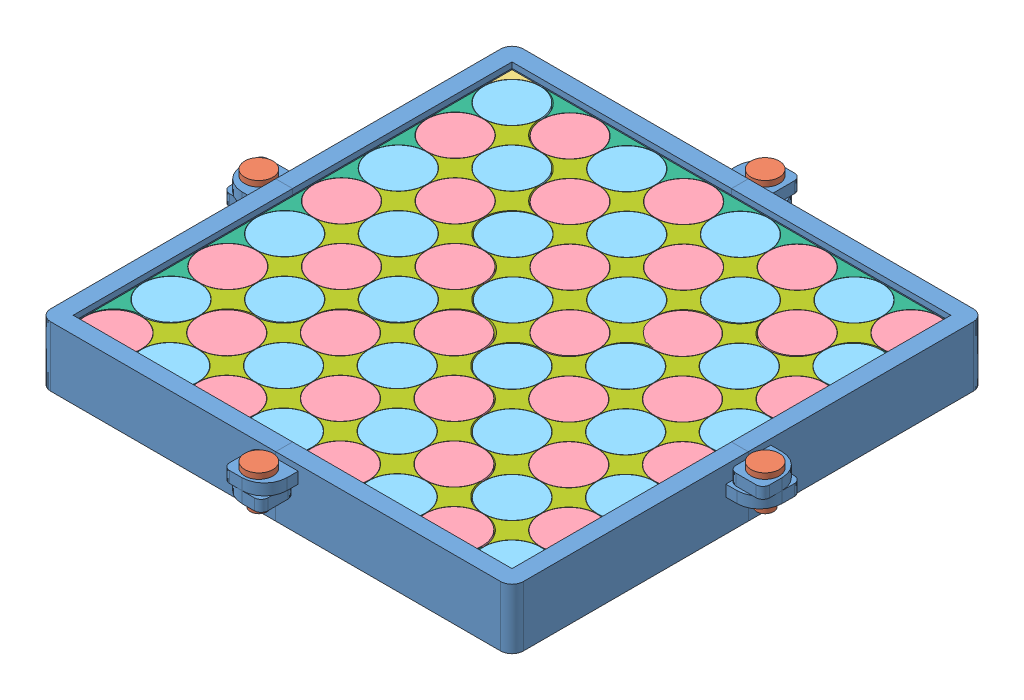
SolidWorks assembly Chess_Board.SLDASM, configuration Default (file format 14000). Lengths in mm.
Overall size (432 48.15 432).
153 component instances, 7 part files, 366 mates.
Components (placement in the parent):
- Holder_Corner-1: Holder_Corner.SLDPRT [Default] at (68.1121 131.9485 205.1787) size (231.3 48.15 231.3)
- Holder_Corner-2: Holder_Corner.SLDPRT [Default] at (252.924 131.9485 205.1787) x (0 0 1) z (-1 0 0) size (231.3 48.15 231.3)
- Holder_Corner-3: Holder_Corner.SLDPRT [Default] at (68.1121 131.9485 389.9906) x (0 0 -1) z (1 0 0) size (231.3 48.15 231.3)
- Holder_Corner-4: Holder_Corner.SLDPRT [Default] at (252.924 131.9485 389.9906) x (-1 0 0) z (0 0 -1) size (231.3 48.15 231.3)
- Screw-2: Screw.SLDPRT [Default] at (-41.9819 148.1985 297.5846) size (22.5 31.5 22.5)
- Screw-3: Screw.SLDPRT [Default] at (160.5181 148.1985 95.0846) size (22.5 31.5 22.5)
- Screw-4: Screw.SLDPRT [Default] at (363.0181 148.1985 297.5846) size (22.5 31.5 22.5)
- Screw-5: Screw.SLDPRT [Default] at (160.5181 148.1985 500.0846) size (22.5 31.5 22.5)
- Black_Quarter_Star-3: Black_Quarter_Star.SLDPRT [Default] at (-22.2948 136.3523 114.7717) x (0 0 -1) z (1 0 0) size (22.5 31.5 22.5)
- Black_Quarter_Star-4: Black_Quarter_Star.SLDPRT [Default] at (-22.2948 136.3523 480.3976) x (-1 0 0) z (0 0 -1) size (22.5 31.5 22.5)
- Black_Quarter_Star-5: Black_Quarter_Star.SLDPRT [Default] at (343.331 136.3523 114.7717) size (22.5 31.5 22.5)
- Black_Quarter_Star-9: Black_Quarter_Star.SLDPRT [Default] at (343.331 171.3523 480.3976) x (1 0 0) z (0 0 -1) size (22.5 31.5 22.5)
- Purple_Circle-1: Purple_Circle.SLDPRT [Default] at (0.9942 136.3523 457.1085) x (-0.637886 0 -0.77013) z (0.77013 0 -0.637886) size (45 31.5 45)
- Purple_Circle-2: Purple_Circle.SLDPRT [Default] at (320.042 136.3523 138.0607) x (-0.897488 0 0.441039) z (-0.441039 0 -0.897488) size (45 31.5 45)
- Green_Circle-1: Green_Circle.SLDPRT [Default] at (0.9942 136.3523 138.0607) x (-0.680782 0 0.732486) z (-0.732486 0 -0.680782) size (45 31.5 45)
- Green_Circle-2: Green_Circle.SLDPRT [Default] at (320.042 136.3523 457.1085) x (-0.065308 0 -0.997865) z (0.997865 0 -0.065308) size (45 31.5 45)
- Black_Half_Star-2: Black_Half_Star.SLDPRT [Default] at (343.3333 136.3523 252.5835) size (22.5 31.5 45)
- Black_Half_Star-3: Black_Half_Star.SLDPRT [Default] at (343.3333 136.9485 161.6835) size (22.5 31.5 45)
- Black_Half_Star-5: Black_Half_Star.SLDPRT [Default] at (343.3333 136.3523 207.1335) size (22.5 31.5 45)
- Black_Half_Star-9: Black_Half_Star.SLDPRT [Default] at (343.3333 136.3523 343.4835) size (22.5 31.5 45)
- Black_Half_Star-10: Black_Half_Star.SLDPRT [Default] at (343.3326 136.3523 388.9335) size (22.5 31.5 45)
- Black_Half_Star-11: Black_Half_Star.SLDPRT [Default] at (343.3333 136.3523 298.0335) size (22.5 31.5 45)
- Black_Half_Star-12: Black_Half_Star.SLDPRT [Default] at (343.3333 136.3523 434.3835) size (22.5 31.5 45)
- Black_Half_Star-13: Black_Half_Star.SLDPRT [Default] at (297.317 136.3523 114.7694) x (0 0 -1) z (1 0 0) size (22.5 31.5 45)
- Black_Half_Star-14: Black_Half_Star.SLDPRT [Default] at (251.867 136.3523 114.7694) x (0 0 -1) z (1 0 0) size (22.5 31.5 45)
- Black_Half_Star-15: Black_Half_Star.SLDPRT [Default] at (206.417 136.3523 114.7694) x (0 0 -1) z (1 0 0) size (22.5 31.5 45)
- Black_Half_Star-16: Black_Half_Star.SLDPRT [Default] at (115.517 136.3523 114.7694) x (0 0 -1) z (1 0 0) size (22.5 31.5 45)
- Black_Half_Star-17: Black_Half_Star.SLDPRT [Default] at (160.967 136.3523 114.7694) x (0 0 -1) z (1 0 0) size (22.5 31.5 45)
- Black_Half_Star-18: Black_Half_Star.SLDPRT [Default] at (70.067 136.3523 114.7694) x (0 0 -1) z (1 0 0) size (22.5 31.5 45)
- Black_Half_Star-19: Black_Half_Star.SLDPRT [Default] at (24.617 136.3523 114.7694) x (0 0 -1) z (1 0 0) size (22.5 31.5 45)
- Black_Half_Star-20: Black_Half_Star.SLDPRT [Default] at (-22.2972 171.3523 342.5857) x (-1 0 0) z (0 0 1) size (22.5 31.5 45)
- Black_Half_Star-21: Black_Half_Star.SLDPRT [Default] at (-22.2972 171.3523 297.1357) x (-1 0 0) z (0 0 1) size (22.5 31.5 45)
- Black_Half_Star-22: Black_Half_Star.SLDPRT [Default] at (-22.2972 171.3523 251.6857) x (-1 0 0) z (0 0 1) size (22.5 31.5 45)
- Black_Half_Star-23: Black_Half_Star.SLDPRT [Default] at (-22.2972 171.3523 388.0357) x (-1 0 0) z (0 0 1) size (22.5 31.5 45)
- Black_Half_Star-24: Black_Half_Star.SLDPRT [Default] at (-22.2972 171.3523 206.2357) x (-1 0 0) z (0 0 1) size (22.5 31.5 45)
- Black_Half_Star-25: Black_Half_Star.SLDPRT [Default] at (-22.2972 171.3523 160.7857) x (-1 0 0) z (0 0 1) size (22.5 31.5 45)
- Black_Half_Star-26: Black_Half_Star.SLDPRT [Default] at (-22.2972 171.3523 433.4857) x (-1 0 0) z (0 0 1) size (22.5 31.5 45)
- Black_Half_Star-27: Black_Half_Star.SLDPRT [Default] at (23.7192 171.3523 480.3999) x (0 0 1) z (1 0 0) size (22.5 31.5 45)
- Black_Half_Star-28: Black_Half_Star.SLDPRT [Default] at (114.6192 171.3523 480.3999) x (0 0 1) z (1 0 0) size (22.5 31.5 45)
- Black_Half_Star-29: Black_Half_Star.SLDPRT [Default] at (69.1692 171.3523 480.3999) x (0 0 1) z (1 0 0) size (22.5 31.5 45)
- Black_Half_Star-30: Black_Half_Star.SLDPRT [Default] at (160.0692 171.3523 480.3999) x (0 0 1) z (1 0 0) size (22.5 31.5 45)
- Black_Half_Star-31: Black_Half_Star.SLDPRT [Default] at (205.5192 171.3523 480.3999) x (0 0 1) z (1 0 0) size (22.5 31.5 45)
- Black_Half_Star-32: Black_Half_Star.SLDPRT [Default] at (250.9692 171.3523 480.3999) x (0 0 1) z (1 0 0) size (22.5 31.5 45)
- Black_Half_Star-33: Black_Half_Star.SLDPRT [Default] at (296.4192 171.3523 480.3999) x (0 0 1) z (1 0 0) size (22.5 31.5 45)
- Purple_Circle-3: Purple_Circle.SLDPRT [Default] at (320.0442 136.3523 229.8585) x (-0.282904 0 0.959148) z (-0.959148 0 -0.282904) size (45 31.5 45)
- Green_Circle-3: Green_Circle.SLDPRT [Default] at (320.0442 136.3523 184.4085) x (0.50891 0 0.86082) z (-0.86082 0 0.50891) size (45 31.5 45)
- Green_Circle-4: Green_Circle.SLDPRT [Default] at (320.0442 136.3523 275.3085) x (0.805839 0 0.592134) z (-0.592134 0 0.805839) size (45 31.5 45)
- Green_Circle-5: Green_Circle.SLDPRT [Default] at (274.592 136.3523 138.0585) x (0.995221 0 -0.097646) z (0.097646 0 0.995221) size (45 31.5 45)
- Green_Circle-6: Green_Circle.SLDPRT [Default] at (0.992 136.3523 410.7607) x (-0.847069 0 -0.531483) z (0.531483 0 -0.847069) size (45 31.5 45)
- Green_Circle-7: Green_Circle.SLDPRT [Default] at (46.4442 136.3523 457.1107) x (0.726506 0 -0.68716) z (0.68716 0 0.726506) size (45 31.5 45)
- Purple_Circle-5: Purple_Circle.SLDPRT [Default] at (0.992 136.3523 365.3107) x (0.976552 0 0.215284) z (-0.215284 0 0.976552) size (45 31.5 45)
- Purple_Circle-6: Purple_Circle.SLDPRT [Default] at (91.8942 136.3523 457.1107) x (0.976552 0 0.215284) z (-0.215284 0 0.976552) size (45 31.5 45)
- Purple_Circle-7: Purple_Circle.SLDPRT [Default] at (0.992 136.3523 183.5107) x (0.976552 0 0.215284) z (-0.215284 0 0.976552) size (45 31.5 45)
- Purple_Circle-8: Purple_Circle.SLDPRT [Default] at (47.342 136.3523 138.0585) x (-0.911317 0 0.411705) z (-0.411705 0 -0.911317) size (45 31.5 45)
- Purple_Circle-9: Purple_Circle.SLDPRT [Default] at (273.6942 136.3523 457.1107) x (0.974403 0 -0.22481) z (0.22481 0 0.974403) size (45 31.5 45)
- Purple_Circle-10: Purple_Circle.SLDPRT [Default] at (320.0442 136.3523 411.6585) x (0.942923 0 0.33301) z (-0.33301 0 0.942923) size (45 31.5 45)
- Purple_Circle-11: Purple_Circle.SLDPRT [Default] at (320.0442 136.3523 320.7585) x (0.803013 0 -0.595962) z (0.595962 0 0.803013) size (45 31.5 45)
- Purple_Circle-12: Purple_Circle.SLDPRT [Default] at (229.142 136.3523 138.0585) x (0.512856 0 0.858475) z (-0.858475 0 0.512856) size (45 31.5 45)
- Green_Circle-8: Green_Circle.SLDPRT [Default] at (320.0435 136.3523 366.2085) x (0.956212 0 0.292674) z (-0.292674 0 0.956212) size (45 31.5 45)
- Green_Circle-9: Green_Circle.SLDPRT [Default] at (228.2442 136.3523 457.1107) x (0.824525 0 0.565826) z (-0.565826 0 0.824525) size (45 31.5 45)
- Green_Circle-10: Green_Circle.SLDPRT [Default] at (137.3442 136.3523 457.1107) x (0.80222 0 0.597029) z (-0.597029 0 0.80222) size (45 31.5 45)
- Green_Circle-11: Green_Circle.SLDPRT [Default] at (183.692 136.3523 138.0585) x (0.824525 0 0.565826) z (-0.565826 0 0.824525) size (45 31.5 45)
- Green_Circle-12: Green_Circle.SLDPRT [Default] at (92.792 136.3523 138.0585) x (-0.124705 0 -0.992194) z (0.992194 0 -0.124705) size (45 31.5 45)
- Green_Circle-13: Green_Circle.SLDPRT [Default] at (0.992 136.3523 319.8607) x (-0.862386 0 0.506252) z (-0.506252 0 -0.862386) size (45 31.5 45)
- Green_Circle-14: Green_Circle.SLDPRT [Default] at (0.992 136.3523 228.9607) x (0.319189 0 0.947691) z (-0.947691 0 0.319189) size (45 31.5 45)
- Purple_Circle-13: Purple_Circle.SLDPRT [Default] at (138.242 136.3523 138.0585) x (0.693303 0 0.720646) z (-0.720646 0 0.693303) size (45 31.5 45)
- Purple_Circle-14: Purple_Circle.SLDPRT [Default] at (0.992 136.3523 274.4107) x (-0.777974 0 -0.628297) z (0.628297 0 -0.777974) size (45 31.5 45)
- Purple_Circle-15: Purple_Circle.SLDPRT [Default] at (182.7942 136.3523 457.1107) x (-0.282904 0 0.959148) z (-0.959148 0 -0.282904) size (45 31.5 45)
- Black_Star-1: Black_Star.SLDPRT [Default] at (23.7181 136.3523 160.7869) x (1 0 0.000049) z (-0.000049 0 1) size (45 31.5 45)
- Black_Star-3: Black_Star.SLDPRT [Default] at (70.067 136.3523 160.7835) size (45 31.5 45)
- Black_Star-4: Black_Star.SLDPRT [Default] at (115.517 136.3523 160.7835) size (45 31.5 45)
- Black_Star-5: Black_Star.SLDPRT [Default] at (160.967 136.3523 160.7835) size (45 31.5 45)
- Black_Star-6: Black_Star.SLDPRT [Default] at (206.417 136.3523 160.7835) size (45 31.5 45)
- Black_Star-7: Black_Star.SLDPRT [Default] at (251.867 136.3523 160.7835) size (45 31.5 45)
- Black_Star-8: Black_Star.SLDPRT [Default] at (297.3159 136.3523 160.7846) x (1 0 0.000049) z (-0.000049 0 1) size (45 31.5 45)
- Black_Star-9: Black_Star.SLDPRT [Default] at (297.3192 136.3523 207.1335) size (45 31.5 45)
- Black_Star-10: Black_Star.SLDPRT [Default] at (297.3192 136.3523 252.5835) size (45 31.5 45)
- Black_Star-11: Black_Star.SLDPRT [Default] at (297.3192 136.3523 298.0335) size (45 31.5 45)
- Black_Star-12: Black_Star.SLDPRT [Default] at (297.3188 136.3523 343.4832) x (1 0 0.000016) z (-0.000016 0 1) size (45 31.5 45)
- Black_Star-13: Black_Star.SLDPRT [Default] at (297.3188 136.3523 388.9339) x (1 0 -0.000016) z (0.000016 0 1) size (45 31.5 45)
- Black_Star-14: Black_Star.SLDPRT [Default] at (297.3181 136.3523 434.3824) x (1 0 0.000049) z (-0.000049 0 1) size (45 31.5 45)
- Black_Star-15: Black_Star.SLDPRT [Default] at (250.9692 136.3523 434.3857) size (45 31.5 45)
- Black_Star-16: Black_Star.SLDPRT [Default] at (205.5192 136.3523 434.3857) size (45 31.5 45)
- Black_Star-17: Black_Star.SLDPRT [Default] at (160.0692 136.3523 434.3857) size (45 31.5 45)
- Black_Star-18: Black_Star.SLDPRT [Default] at (114.6192 136.3523 434.3857) size (45 31.5 45)
- Black_Star-19: Black_Star.SLDPRT [Default] at (69.1692 136.3523 434.3857) size (45 31.5 45)
- Black_Star-20: Black_Star.SLDPRT [Default] at (23.7203 136.3523 434.3846) x (1 0 0.000049) z (-0.000049 0 1) size (45 31.5 45)
- Black_Star-21: Black_Star.SLDPRT [Default] at (23.717 136.3523 388.0357) size (45 31.5 45)
- Black_Star-22: Black_Star.SLDPRT [Default] at (23.717 136.3523 342.5857) size (45 31.5 45)
- Black_Star-23: Black_Star.SLDPRT [Default] at (23.717 136.3523 297.1357) size (45 31.5 45)
- Black_Star-24: Black_Star.SLDPRT [Default] at (23.717 136.3523 251.6857) size (45 31.5 45)
- Black_Star-25: Black_Star.SLDPRT [Default] at (23.717 136.3523 206.2357) size (45 31.5 45)
- Green_Circle-15: Green_Circle.SLDPRT [Default] at (46.442 136.3523 183.5107) x (0.824525 0 0.565826) z (-0.565826 0 0.824525) size (45 31.5 45)
- Green_Circle-16: Green_Circle.SLDPRT [Default] at (46.442 136.3523 274.4107) x (0.824525 0 0.565826) z (-0.565826 0 0.824525) size (45 31.5 45)
- Green_Circle-17: Green_Circle.SLDPRT [Default] at (46.442 136.3523 365.3107) x (0.824525 0 0.565826) z (-0.565826 0 0.824525) size (45 31.5 45)
- Green_Circle-18: Green_Circle.SLDPRT [Default] at (91.8942 136.3523 411.6607) x (0.824525 0 0.565826) z (-0.565826 0 0.824525) size (45 31.5 45)
- Green_Circle-19: Green_Circle.SLDPRT [Default] at (182.7942 136.3523 411.6607) x (0.824525 0 0.565826) z (-0.565826 0 0.824525) size (45 31.5 45)
- Green_Circle-20: Green_Circle.SLDPRT [Default] at (274.5942 136.3523 411.6563) x (-0.712334 0 -0.701841) z (0.701841 0 -0.712334) size (45 31.5 45)
- Green_Circle-21: Green_Circle.SLDPRT [Default] at (274.5942 136.3523 320.7578) x (0.824525 0 0.565826) z (-0.565826 0 0.824525) size (45 31.5 45)
- Green_Circle-22: Green_Circle.SLDPRT [Default] at (274.5942 136.3523 229.8585) x (0.824525 0 0.565826) z (-0.565826 0 0.824525) size (45 31.5 45)
- Green_Circle-23: Green_Circle.SLDPRT [Default] at (229.142 136.3523 183.5085) x (0.824525 0 0.565826) z (-0.565826 0 0.824525) size (45 31.5 45)
- Green_Circle-24: Green_Circle.SLDPRT [Default] at (138.242 136.3523 183.5085) x (0.824525 0 0.565826) z (-0.565826 0 0.824525) size (45 31.5 45)
- Purple_Circle-17: Purple_Circle.SLDPRT [Default] at (274.592 136.3523 183.5085) x (-0.777974 0 -0.628297) z (0.628297 0 -0.777974) size (45 31.5 45)
- Purple_Circle-18: Purple_Circle.SLDPRT [Default] at (46.442 136.3523 228.9607) x (-0.777974 0 -0.628297) z (0.628297 0 -0.777974) size (45 31.5 45)
- Purple_Circle-19: Purple_Circle.SLDPRT [Default] at (46.442 136.3523 319.8607) x (-0.777974 0 -0.628297) z (0.628297 0 -0.777974) size (45 31.5 45)
- Purple_Circle-20: Purple_Circle.SLDPRT [Default] at (46.4442 136.3523 411.6607) x (-0.777974 0 -0.628297) z (0.628297 0 -0.777974) size (45 31.5 45)
- Purple_Circle-21: Purple_Circle.SLDPRT [Default] at (137.3442 136.3523 411.6607) x (-0.777974 0 -0.628297) z (0.628297 0 -0.777974) size (45 31.5 45)
- Purple_Circle-22: Purple_Circle.SLDPRT [Default] at (228.2442 136.3523 411.6607) x (-0.603591 0 -0.797294) z (0.797294 0 -0.603591) size (45 31.5 45)
- Purple_Circle-23: Purple_Circle.SLDPRT [Default] at (274.5935 136.3523 366.2078) x (-0.777974 0 -0.628297) z (0.628297 0 -0.777974) size (45 31.5 45)
- Purple_Circle-24: Purple_Circle.SLDPRT [Default] at (274.5942 136.3523 275.3085) x (-0.777974 0 -0.628297) z (0.628297 0 -0.777974) size (45 31.5 45)
- Purple_Circle-25: Purple_Circle.SLDPRT [Default] at (183.692 136.3523 183.5085) x (-0.777974 0 -0.628297) z (0.628297 0 -0.777974) size (45 31.5 45)
- Purple_Circle-26: Purple_Circle.SLDPRT [Default] at (92.792 136.3523 183.5085) x (-0.340064 0 -0.940402) z (0.940402 0 -0.340064) size (45 31.5 45)
- Black_Star-26: Black_Star.SLDPRT [Default] at (251.8692 136.3523 252.5835) size (45 31.5 45)
- Black_Star-27: Black_Star.SLDPRT [Default] at (251.8692 136.3523 298.0328) size (45 31.5 45)
- Black_Star-28: Black_Star.SLDPRT [Default] at (251.8688 136.3523 343.4824) x (1 0 0.000016) z (-0.000016 0 1) size (45 31.5 45)
- Black_Star-30: Black_Star.SLDPRT [Default] at (205.5192 136.3523 388.9357) size (45 31.5 45)
- Black_Star-31: Black_Star.SLDPRT [Default] at (160.0692 136.3523 388.9357) size (45 31.5 45)
- Black_Star-32: Black_Star.SLDPRT [Default] at (114.6192 136.3523 388.9357) size (45 31.5 45)
- Black_Star-33: Black_Star.SLDPRT [Default] at (251.8688 136.3523 388.9317) x (1 0 -0.000016) z (0.000016 0 1) size (45 31.5 45)
- Black_Star-34: Black_Star.SLDPRT [Default] at (69.1692 136.3523 388.9357) size (45 31.5 45)
- Black_Star-36: Black_Star.SLDPRT [Default] at (69.167 136.3523 342.5857) size (45 31.5 45)
- Black_Star-37: Black_Star.SLDPRT [Default] at (251.8692 136.3523 207.1335) size (45 31.5 45)
- Black_Star-38: Black_Star.SLDPRT [Default] at (69.167 136.3523 297.1357) size (45 31.5 45)
- Black_Star-39: Black_Star.SLDPRT [Default] at (69.167 136.3523 251.6857) size (45 31.5 45)
- Black_Star-40: Black_Star.SLDPRT [Default] at (69.167 136.3523 206.2357) size (45 31.5 45)
- Black_Star-41: Black_Star.SLDPRT [Default] at (115.517 136.3523 206.2335) size (45 31.5 45)
- Black_Star-43: Black_Star.SLDPRT [Default] at (160.967 136.3523 206.2335) size (45 31.5 45)
- Black_Star-44: Black_Star.SLDPRT [Default] at (206.417 136.3523 206.2335) size (45 31.5 45)
- Purple_Circle-27: Purple_Circle.SLDPRT [Default] at (229.1442 136.3523 229.8585) x (0.686183 0 -0.727429) z (0.727429 0 0.686183) size (45 31.5 45)
- Purple_Circle-28: Purple_Circle.SLDPRT [Default] at (229.1442 136.3523 320.7578) x (0.093123 0 -0.995655) z (0.995655 0 0.093123) size (45 31.5 45)
- Purple_Circle-29: Purple_Circle.SLDPRT [Default] at (182.7942 136.3523 366.2107) x (0.512856 0 0.858475) z (-0.858475 0 0.512856) size (45 31.5 45)
- Purple_Circle-30: Purple_Circle.SLDPRT [Default] at (91.8942 136.3523 366.2107) x (0.835671 0 -0.54923) z (0.54923 0 0.835671) size (45 31.5 45)
- Purple_Circle-31: Purple_Circle.SLDPRT [Default] at (91.892 136.3523 274.4107) x (0.512856 0 0.858475) z (-0.858475 0 0.512856) size (45 31.5 45)
- Purple_Circle-32: Purple_Circle.SLDPRT [Default] at (138.242 136.3523 228.9585) x (-0.841302 0 0.540565) z (-0.540565 0 -0.841302) size (45 31.5 45)
- Green_Circle-25: Green_Circle.SLDPRT [Default] at (183.692 136.3523 228.9585) x (0.824525 0 0.565826) z (-0.565826 0 0.824525) size (45 31.5 45)
- Green_Circle-26: Green_Circle.SLDPRT [Default] at (137.3442 136.3523 366.2107) x (0.824525 0 0.565826) z (-0.565826 0 0.824525) size (45 31.5 45)
- Green_Circle-27: Green_Circle.SLDPRT [Default] at (92.792 136.3523 228.9585) x (-0.451539 0 0.892251) z (-0.892251 0 -0.451539) size (45 31.5 45)
- Green_Circle-28: Green_Circle.SLDPRT [Default] at (229.1435 136.3523 366.207) x (0.367786 0 -0.92991) z (0.92991 0 0.367786) size (45 31.5 45)
- Green_Circle-29: Green_Circle.SLDPRT [Default] at (229.1442 136.3523 275.3078) x (0.824525 0 0.565826) z (-0.565826 0 0.824525) size (45 31.5 45)
- Green_Circle-30: Green_Circle.SLDPRT [Default] at (91.892 136.3523 319.8607) x (0.824525 0 0.565826) z (-0.565826 0 0.824525) size (45 31.5 45)
- Black_Star-45: Black_Star.SLDPRT [Default] at (160.0692 136.3523 343.4857) size (45 31.5 45)
- Black_Star-46: Black_Star.SLDPRT [Default] at (114.617 136.3523 297.1357) x (0 0 -1) z (1 0 0) size (45 31.5 45)
- Black_Star-47: Black_Star.SLDPRT [Default] at (114.6192 136.3523 343.4857) size (45 31.5 45)
- Black_Star-49: Black_Star.SLDPRT [Default] at (115.517 136.3523 251.6835) x (0 0 1) z (-1 0 0) size (45 31.5 45)
- Black_Star-50: Black_Star.SLDPRT [Default] at (160.967 136.3523 251.6835) size (45 31.5 45)
- Black_Star-51: Black_Star.SLDPRT [Default] at (206.417 136.3523 251.6835) size (45 31.5 45)
- Black_Star-52: Black_Star.SLDPRT [Default] at (206.4192 136.3523 298.0328) size (45 31.5 45)
- Black_Star-53: Black_Star.SLDPRT [Default] at (206.4192 136.3523 343.4828) size (45 31.5 45)
- Green_Circle-31: Green_Circle.SLDPRT [Default] at (138.242 136.3523 274.4085) x (0.026441 0 -0.99965) z (0.99965 0 0.026441) size (45 31.5 45)
- Green_Circle-33: Green_Circle.SLDPRT [Default] at (183.6942 136.3523 320.7578) x (0.997626 0 -0.068863) z (0.068863 0 0.997626) size (45 31.5 45)
- Purple_Circle-33: Purple_Circle.SLDPRT [Default] at (183.692 136.3523 274.4085) x (0.705995 0 0.708217) z (-0.708217 0 0.705995) size (45 31.5 45)
- Purple_Circle-34: Purple_Circle.SLDPRT [Default] at (137.3442 136.3523 320.7607) x (-0.947815 0 -0.31882) z (0.31882 0 -0.947815) size (45 31.5 45)
- Black_Star-54: Black_Star.SLDPRT [Default] at (160.967 136.3523 297.1335) size (45 31.5 45)
Mates (geometry in assembly coordinates):
- Coincident1: coincident anti-aligned: plane of Holder_Corner-1 through (-28.4819 138.1023 297.5846) normal (0 0 1); plane of Holder_Corner-3 through (160.5181 138.1023 297.5846) normal (0 0 -1)
- Distance1: distance anti-aligned: plane of Holder_Corner-1 through (-37.4819 168.2523 297.5846) normal (0 1 0); plane of Holder_Corner-3 through (-37.4819 168.2523 297.5846) normal (0 -1 0)
- Concentric1: concentric aligned: cylinder of Holder_Corner-1 through (-41.9819 133.6023 297.5846) axis (0 1 0) radius 7.2; cylinder of Holder_Corner-3 through (-41.9819 133.6023 297.5846) axis (0 1 0) radius 7.2
- Distance3: distance anti-aligned: plane of Holder_Corner-3 through (160.5181 168.2523 495.5846) normal (0 1 0); plane of Holder_Corner-4 through (160.5181 168.2523 495.5846) normal (0 -1 0)
- Concentric2: concentric aligned: cylinder of Holder_Corner-3 through (160.5181 133.6023 500.0846) axis (0 1 0) radius 7.2; unknown of Holder_Corner-4
- Coincident5: coincident anti-aligned: plane of Holder_Corner-3 through (160.5181 138.1023 486.5846) normal (1 0 0); plane of Holder_Corner-4 through (160.5181 138.1023 297.5846) normal (-1 0 0)
- Coincident7: coincident anti-aligned: plane of Holder_Corner-1 through (160.5181 138.1023 297.5846) normal (1 0 0); plane of Holder_Corner-2 through (160.5181 138.1023 108.5846) normal (-1 0 0)
- Distance2: distance anti-aligned: plane of Holder_Corner-2 through (358.5181 168.2523 297.5846) normal (0 -1 0); plane of Holder_Corner-4 through (358.5181 168.2523 297.5846) normal (0 1 0)
- Concentric3: concentric aligned: cylinder of Holder_Corner-2 through (363.0181 133.6023 297.5846) axis (0 1 0) radius 7.2; cylinder of Holder_Corner-4 through (363.0181 133.6023 297.5846) axis (0 1 0) radius 7.2
- Concentric5: concentric anti-aligned: cylinder of Holder_Corner-3 through (-41.9819 133.6023 297.5846) axis (0 1 0) radius 7.2; cylinder of Screw-2 through (-41.9819 177.2523 297.5846) axis (0 -1 0) radius 6.75
- Coincident10: coincident anti-aligned: plane of Holder_Corner-3 through (-28.4819 177.2523 392.0846) normal (0 1 0); plane of Screw-2 through (-41.9819 177.2523 297.5846) normal (0 -1 0)
- Concentric6: concentric anti-aligned: cylinder of Holder_Corner-1 through (160.5181 133.6023 95.0846) axis (0 1 0) radius 7.2; cylinder of Screw-3 through (160.5181 177.2523 95.0846) axis (0 -1 0) radius 6.75
- Coincident11: coincident anti-aligned: plane of Holder_Corner-1 through (66.0181 177.2523 108.5846) normal (0 1 0); plane of Screw-3 through (160.5181 177.2523 95.0846) normal (0 -1 0)
- Concentric7: concentric anti-aligned: cylinder of Holder_Corner-2 through (363.0181 133.6023 297.5846) axis (0 1 0) radius 7.2; cylinder of Screw-4 through (363.0181 177.2523 297.5846) axis (0 -1 0) radius 6.75
- Coincident12: coincident anti-aligned: plane of Holder_Corner-2 through (349.5181 177.2523 203.0846) normal (0 1 0); plane of Screw-4 through (363.0181 177.2523 297.5846) normal (0 -1 0)
- Concentric8: concentric anti-aligned: cylinder of Holder_Corner-4 through (160.5181 133.6023 500.0846) axis (0 1 0) radius 7.2; cylinder of Screw-5 through (160.5181 177.2523 500.0846) axis (0 -1 0) radius 6.75
- Coincident13: coincident anti-aligned: plane of Holder_Corner-4 through (255.0181 177.2523 486.5846) normal (0 1 0); plane of Screw-5 through (160.5181 177.2523 500.0846) normal (0 -1 0)
- Coincident15: coincident anti-aligned: plane of Holder_Corner-3 through (-21.7319 133.6023 486.5846) normal (1 0 0); plane of Black_Quarter_Star-3 through (-21.7319 138.1023 137.8357) normal (-1 0 0)
- Coincident16: coincident anti-aligned: plane of Holder_Corner-1 through (-28.4819 133.6023 115.3346) normal (0 0 1); plane of Black_Quarter_Star-3 through (-44.2308 138.1023 115.3346) normal (0 0 -1)
- Coincident17: coincident anti-aligned: plane of Holder_Corner-1 through (66.0181 138.1023 203.0846) normal (0 1 0); plane of Black_Quarter_Star-3 through (-21.7308 138.1023 115.3357) normal (0 -1 0)
- Coincident18: coincident anti-aligned: plane of Holder_Corner-3 through (-21.7319 133.6023 486.5846) normal (1 0 0); plane of Black_Quarter_Star-4 through (-21.7319 138.1023 502.3335) normal (-1 0 0)
- Coincident19: coincident anti-aligned: plane of Holder_Corner-3 through (-28.4819 133.6023 479.8346) normal (0 0 -1); plane of Black_Quarter_Star-4 through (0.7692 138.1023 479.8346) normal (0 0 1)
- Coincident20: coincident anti-aligned: plane of Holder_Corner-3 through (66.0181 138.1023 392.0846) normal (0 1 0); plane of Black_Quarter_Star-4 through (-21.7308 138.1023 479.8335) normal (0 -1 0)
- Coincident24: coincident anti-aligned: plane of Holder_Corner-4 through (342.7681 133.6023 486.5846) normal (-1 0 0); plane of Black_Quarter_Star-9 through (342.7681 169.6023 502.3335) normal (1 0 0)
- Coincident25: coincident anti-aligned: plane of Holder_Corner-4 through (349.5181 133.6023 479.8346) normal (0 0 -1); plane of Black_Quarter_Star-9 through (320.267 169.6023 479.8346) normal (0 0 1)
- Coincident26: coincident anti-aligned: plane of Holder_Corner-4 through (255.0181 138.1023 392.0846) normal (0 1 0); plane of Black_Quarter_Star-9 through (342.767 138.1023 479.8335) normal (0 -1 0)
- Coincident27: coincident anti-aligned: plane of Holder_Corner-2 through (349.5181 133.6023 115.3346) normal (0 0 1); plane of Black_Quarter_Star-5 through (320.267 138.1023 115.3346) normal (0 0 -1)
- Coincident28: coincident anti-aligned: plane of Holder_Corner-2 through (342.7681 133.6023 108.5846) normal (-1 0 0); plane of Black_Quarter_Star-5 through (342.7681 138.1023 92.8357) normal (1 0 0)
- Coincident29: coincident anti-aligned: plane of Holder_Corner-2 through (255.0181 138.1023 203.0846) normal (0 1 0); plane of Black_Quarter_Star-5 through (342.767 138.1023 115.3357) normal (0 -1 0)
- Coincident30: coincident anti-aligned: plane of Holder_Corner-2 through (255.0181 138.1023 203.0846) normal (0 1 0); plane of Purple_Circle-2 through (320.042 138.1023 138.0607) normal (0 -1 0)
- Concentric9: concentric aligned: cylinder of Black_Quarter_Star-5 through (320.042 169.6023 138.0607) axis (0 -1 0) radius 22.725; cylinder of Purple_Circle-2 through (320.042 169.6023 138.0607) axis (0 -1 0) radius 22.5
- Concentric10: concentric aligned: cylinder of Black_Quarter_Star-4 through (0.9942 169.6023 457.1085) axis (0 -1 0) radius 22.725; cylinder of Purple_Circle-1 through (0.9942 169.6023 457.1085) axis (0 -1 0) radius 22.5
- Concentric11: concentric aligned: cylinder of Black_Quarter_Star-3 through (0.9942 169.6023 138.0607) axis (0 -1 0) radius 22.725; cylinder of Green_Circle-1 through (0.9942 169.6023 138.0607) axis (0 -1 0) radius 22.5
- Coincident31: coincident anti-aligned: plane of Holder_Corner-1 through (66.0181 138.1023 203.0846) normal (0 1 0); plane of Green_Circle-1 through (0.9942 138.1023 138.0607) normal (0 -1 0)
- Concentric12: concentric anti-aligned: cylinder of Black_Quarter_Star-9 through (320.042 138.1023 457.1085) axis (0 1 0) radius 22.725; cylinder of Green_Circle-2 through (320.042 169.6023 457.1085) axis (0 -1 0) radius 22.5
- Coincident32: coincident anti-aligned: plane of Holder_Corner-4 through (255.0181 138.1023 392.0846) normal (0 1 0); plane of Green_Circle-2 through (320.042 138.1023 457.1085) normal (0 -1 0)
- Coincident36: coincident anti-aligned: plane of Holder_Corner-2 through (342.7681 133.6023 108.5846) normal (-1 0 0); plane of Black_Half_Star-2 through (342.7681 169.6023 275.0835) normal (1 0 0)
- Coincident37: coincident anti-aligned: plane of Holder_Corner-4 through (255.0181 138.1023 392.0846) normal (0 1 0); plane of Black_Half_Star-2 through (342.7692 138.1023 252.5835) normal (0 -1 0)
- Coincident38: coincident anti-aligned: plane of Holder_Corner-2 through (342.7681 133.6023 108.5846) normal (-1 0 0); plane of Black_Half_Star-9 through (342.7681 169.6023 365.9835) normal (1 0 0)
- Coincident39: coincident anti-aligned: plane of Holder_Corner-2 through (255.0181 138.1023 203.0846) normal (0 1 0); plane of Black_Half_Star-9 through (342.7692 138.1023 343.4835) normal (0 -1 0)
- Coincident40: coincident anti-aligned: plane of Holder_Corner-4 through (342.7681 133.6023 486.5846) normal (-1 0 0); plane of Black_Half_Star-10 through (342.7673 169.6023 411.4335) normal (1 0 0)
- Coincident41: coincident anti-aligned: plane of Holder_Corner-4 through (255.0181 138.1023 392.0846) normal (0 1 0); plane of Black_Half_Star-10 through (342.7685 138.1023 388.9335) normal (0 -1 0)
- Coincident42: coincident anti-aligned: plane of Holder_Corner-4 through (255.0181 138.1023 392.0846) normal (0 1 0); plane of Black_Half_Star-12 through (342.7692 138.1023 434.3835) normal (0 -1 0)
- Coincident43: coincident anti-aligned: plane of Holder_Corner-4 through (342.7681 133.6023 486.5846) normal (-1 0 0); plane of Black_Half_Star-12 through (342.7681 169.6023 456.8835) normal (1 0 0)
- Coincident44: coincident anti-aligned: plane of Holder_Corner-2 through (255.0181 138.1023 203.0846) normal (0 1 0); plane of Black_Half_Star-11 through (342.7692 138.1023 298.0335) normal (0 -1 0)
- Coincident45: coincident anti-aligned: plane of Holder_Corner-2 through (342.7681 133.6023 108.5846) normal (-1 0 0); plane of Black_Half_Star-11 through (342.7681 169.6023 320.5335) normal (1 0 0)
- Coincident46: coincident anti-aligned: plane of Holder_Corner-2 through (255.0181 138.1023 203.0846) normal (0 1 0); plane of Black_Half_Star-5 through (342.7692 138.1023 207.1335) normal (0 -1 0)
- Coincident47: coincident anti-aligned: plane of Holder_Corner-2 through (342.7681 133.6023 108.5846) normal (-1 0 0); plane of Black_Half_Star-5 through (342.7681 169.6023 229.6335) normal (1 0 0)
- Coincident48: coincident anti-aligned: plane of Holder_Corner-2 through (349.5181 133.6023 115.3346) normal (0 0 1); plane of Black_Half_Star-13 through (319.817 169.6023 115.3346) normal (0 0 -1)
- Coincident49: coincident anti-aligned: plane of Holder_Corner-2 through (255.0181 138.1023 203.0846) normal (0 1 0); plane of Black_Half_Star-13 through (297.317 138.1023 115.3335) normal (0 -1 0)
- Coincident50: coincident anti-aligned: plane of Holder_Corner-2 through (349.5181 133.6023 115.3346) normal (0 0 1); plane of Black_Half_Star-14 through (274.367 169.6023 115.3346) normal (0 0 -1)
- Coincident51: coincident anti-aligned: plane of Holder_Corner-2 through (255.0181 138.1023 203.0846) normal (0 1 0); plane of Black_Half_Star-14 through (251.867 138.1023 115.3335) normal (0 -1 0)
- Coincident52: coincident anti-aligned: plane of Holder_Corner-2 through (349.5181 133.6023 115.3346) normal (0 0 1); plane of Black_Half_Star-15 through (228.917 169.6023 115.3346) normal (0 0 -1)
- Coincident53: coincident anti-aligned: plane of Holder_Corner-2 through (255.0181 138.1023 203.0846) normal (0 1 0); plane of Black_Half_Star-15 through (206.417 138.1023 115.3335) normal (0 -1 0)
- Coincident54: coincident anti-aligned: plane of Holder_Corner-2 through (349.5181 133.6023 115.3346) normal (0 0 1); plane of Black_Half_Star-16 through (138.017 169.6023 115.3346) normal (0 0 -1)
- Coincident55: coincident anti-aligned: plane of Holder_Corner-2 through (255.0181 138.1023 203.0846) normal (0 1 0); plane of Black_Half_Star-16 through (115.517 138.1023 115.3335) normal (0 -1 0)
- Coincident56: coincident anti-aligned: plane of Holder_Corner-1 through (-28.4819 133.6023 115.3346) normal (0 0 1); plane of Black_Half_Star-17 through (183.467 169.6023 115.3346) normal (0 0 -1)
- Coincident57: coincident anti-aligned: plane of Holder_Corner-1 through (66.0181 138.1023 203.0846) normal (0 1 0); plane of Black_Half_Star-17 through (160.967 138.1023 115.3335) normal (0 -1 0)
- Coincident58: coincident anti-aligned: plane of Holder_Corner-1 through (-28.4819 133.6023 115.3346) normal (0 0 1); plane of Black_Half_Star-18 through (92.567 169.6023 115.3346) normal (0 0 -1)
- Coincident59: coincident anti-aligned: plane of Holder_Corner-1 through (66.0181 138.1023 203.0846) normal (0 1 0); plane of Black_Half_Star-18 through (70.067 138.1023 115.3335) normal (0 -1 0)
- Coincident60: coincident anti-aligned: plane of Holder_Corner-1 through (-28.4819 133.6023 115.3346) normal (0 0 1); plane of Black_Half_Star-19 through (47.117 169.6023 115.3346) normal (0 0 -1)
- Coincident61: coincident anti-aligned: plane of Holder_Corner-1 through (66.0181 138.1023 203.0846) normal (0 1 0); plane of Black_Half_Star-19 through (24.617 138.1023 115.3335) normal (0 -1 0)
- Coincident63: coincident anti-aligned: plane of Holder_Corner-1 through (-21.7319 133.6023 108.5846) normal (1 0 0); plane of Black_Half_Star-25 through (-21.7319 138.1023 183.2857) normal (-1 0 0)
- Coincident64: coincident anti-aligned: plane of Holder_Corner-1 through (66.0181 138.1023 203.0846) normal (0 1 0); plane of Black_Half_Star-25 through (-21.733 138.1023 160.7857) normal (0 -1 0)
- Coincident65: coincident anti-aligned: plane of Holder_Corner-1 through (66.0181 138.1023 203.0846) normal (0 1 0); plane of Black_Half_Star-21 through (-21.733 138.1023 297.1357) normal (0 -1 0)
- Coincident67: coincident anti-aligned: plane of Holder_Corner-1 through (-21.7319 133.6023 108.5846) normal (1 0 0); plane of Black_Half_Star-24 through (-21.7319 138.1023 228.7357) normal (-1 0 0)
- Coincident68: coincident anti-aligned: plane of Holder_Corner-1 through (66.0181 138.1023 203.0846) normal (0 1 0); plane of Black_Half_Star-24 through (-21.733 138.1023 206.2357) normal (0 -1 0)
- Coincident69: coincident anti-aligned: plane of Holder_Corner-1 through (-21.7319 133.6023 108.5846) normal (1 0 0); plane of Black_Half_Star-20 through (-21.7319 138.1023 365.0857) normal (-1 0 0)
- Coincident70: coincident anti-aligned: plane of Holder_Corner-1 through (66.0181 138.1023 203.0846) normal (0 1 0); plane of Black_Half_Star-20 through (-21.733 138.1023 342.5857) normal (0 -1 0)
- Coincident71: coincident anti-aligned: plane of Holder_Corner-1 through (-21.7319 133.6023 108.5846) normal (1 0 0); plane of Black_Half_Star-21 through (-21.7319 138.1023 319.6357) normal (-1 0 0)
- Coincident72: coincident anti-aligned: plane of Holder_Corner-3 through (-21.7319 133.6023 486.5846) normal (1 0 0); plane of Black_Half_Star-22 through (-21.7319 138.1023 274.1857) normal (-1 0 0)
- Coincident73: coincident anti-aligned: plane of Holder_Corner-3 through (66.0181 138.1023 392.0846) normal (0 1 0); plane of Black_Half_Star-22 through (-21.733 138.1023 251.6857) normal (0 -1 0)
- Coincident74: coincident anti-aligned: plane of Holder_Corner-3 through (-21.7319 133.6023 486.5846) normal (1 0 0); plane of Black_Half_Star-23 through (-21.7319 138.1023 410.5357) normal (-1 0 0)
- Coincident75: coincident anti-aligned: plane of Holder_Corner-3 through (66.0181 138.1023 392.0846) normal (0 1 0); plane of Black_Half_Star-23 through (-21.733 138.1023 388.0357) normal (0 -1 0)
- Coincident76: coincident anti-aligned: plane of Holder_Corner-3 through (-21.7319 133.6023 486.5846) normal (1 0 0); plane of Black_Half_Star-26 through (-21.7319 138.1023 455.9857) normal (-1 0 0)
- Coincident77: coincident anti-aligned: plane of Holder_Corner-3 through (66.0181 138.1023 392.0846) normal (0 1 0); plane of Black_Half_Star-26 through (-21.733 138.1023 433.4857) normal (0 -1 0)
- Coincident78: coincident anti-aligned: plane of Holder_Corner-3 through (-28.4819 133.6023 479.8346) normal (0 0 -1); plane of Black_Half_Star-27 through (46.2192 138.1023 479.8346) normal (0 0 1)
- Coincident79: coincident anti-aligned: plane of Holder_Corner-3 through (66.0181 138.1023 392.0846) normal (0 1 0); plane of Black_Half_Star-27 through (23.7192 138.1023 479.8357) normal (0 -1 0)
- Coincident80: coincident anti-aligned: plane of Holder_Corner-3 through (-28.4819 133.6023 479.8346) normal (0 0 -1); plane of Black_Half_Star-28 through (137.1192 138.1023 479.8346) normal (0 0 1)
- Coincident81: coincident anti-aligned: plane of Holder_Corner-3 through (66.0181 138.1023 392.0846) normal (0 1 0); plane of Black_Half_Star-28 through (114.6192 138.1023 479.8357) normal (0 -1 0)
- Coincident82: coincident anti-aligned: plane of Holder_Corner-3 through (-28.4819 133.6023 479.8346) normal (0 0 -1); plane of Black_Half_Star-29 through (91.6692 138.1023 479.8346) normal (0 0 1)
- Coincident83: coincident anti-aligned: plane of Holder_Corner-3 through (66.0181 138.1023 392.0846) normal (0 1 0); plane of Black_Half_Star-29 through (69.1692 138.1023 479.8357) normal (0 -1 0)
- Coincident84: coincident anti-aligned: plane of Holder_Corner-4 through (349.5181 133.6023 479.8346) normal (0 0 -1); plane of Black_Half_Star-30 through (194.9903 138.1023 479.8346) normal (0 0 1)
- Coincident85: coincident anti-aligned: plane of Holder_Corner-4 through (255.0181 138.1023 392.0846) normal (0 1 0); plane of Black_Half_Star-30 through (172.4903 138.1023 479.8357) normal (0 -1 0)
- Coincident86: coincident anti-aligned: plane of Holder_Corner-3 through (66.0181 138.1023 392.0846) normal (0 1 0); plane of Purple_Circle-1 through (0.9942 138.1023 457.1085) normal (0 -1 0)
- Coincident87: coincident anti-aligned: plane of Holder_Corner-4 through (349.5181 133.6023 479.8346) normal (0 0 -1); plane of Black_Half_Star-31 through (228.0192 138.1023 479.8346) normal (0 0 1)
- Coincident88: coincident anti-aligned: plane of Holder_Corner-4 through (255.0181 138.1023 392.0846) normal (0 1 0); plane of Black_Half_Star-31 through (205.5192 138.1023 479.8357) normal (0 -1 0)
- Coincident89: coincident anti-aligned: plane of Holder_Corner-4 through (349.5181 133.6023 479.8346) normal (0 0 -1); plane of Black_Half_Star-32 through (273.4692 138.1023 479.8346) normal (0 0 1)
- Coincident90: coincident anti-aligned: plane of Holder_Corner-4 through (255.0181 138.1023 392.0846) normal (0 1 0); plane of Black_Half_Star-32 through (250.9692 138.1023 479.8357) normal (0 -1 0)
- Coincident91: coincident anti-aligned: plane of Holder_Corner-4 through (349.5181 133.6023 479.8346) normal (0 0 -1); plane of Black_Half_Star-33 through (318.9192 138.1023 479.8346) normal (0 0 1)
- Coincident92: coincident anti-aligned: plane of Holder_Corner-4 through (255.0181 138.1023 392.0846) normal (0 1 0); plane of Black_Half_Star-33 through (296.4192 138.1023 479.8357) normal (0 -1 0)
- Concentric13: concentric aligned: cylinder of Black_Half_Star-5 through (320.0442 169.6023 229.8585) axis (0 -1 0) radius 22.725; cylinder of Purple_Circle-3 through (320.0442 169.6023 229.8585) axis (0 -1 0) radius 22.5
- Concentric14: concentric aligned: cylinder of Black_Half_Star-2 through (320.0442 169.6023 229.8585) axis (0 -1 0) radius 22.725; cylinder of Purple_Circle-3 through (320.0442 169.6023 229.8585) axis (0 -1 0) radius 22.5
- Coincident93: coincident anti-aligned: plane of Holder_Corner-2 through (255.0181 138.1023 203.0846) normal (0 1 0); plane of Purple_Circle-3 through (320.0442 138.1023 229.8585) normal (0 -1 0)
- Concentric15: concentric aligned: cylinder of Black_Half_Star-3 through (320.0442 170.1985 184.4085) axis (0 -1 0) radius 22.725; cylinder of Green_Circle-3 through (320.0442 169.6023 184.4085) axis (0 -1 0) radius 22.5
- Coincident94: coincident anti-aligned: plane of Holder_Corner-2 through (342.7681 133.6023 108.5846) normal (-1 0 0); plane of Black_Half_Star-3 through (342.7681 170.1985 184.1835) normal (1 0 0)
- Coincident95: coincident anti-aligned: plane of Holder_Corner-2 through (255.0181 138.1023 203.0846) normal (0 1 0); plane of Green_Circle-3 through (320.0442 138.1023 184.4085) normal (0 -1 0)
- Parallel1: parallel aligned: cylinder of Purple_Circle-2 through (320.042 169.6023 138.0607) axis (0 -1 0) radius 22.5; cylinder of Black_Half_Star-3 through (320.0442 170.1985 138.9585) axis (0 -1 0) radius 22.725
- Concentric17: concentric aligned: cylinder of Black_Half_Star-2 through (320.0442 169.6023 275.3085) axis (0 -1 0) radius 22.725; cylinder of Green_Circle-4 through (320.0442 169.6023 275.3085) axis (0 -1 0) radius 22.5
- Coincident96: coincident anti-aligned: plane of Holder_Corner-2 through (255.0181 138.1023 203.0846) normal (0 1 0); plane of Green_Circle-4 through (320.0442 138.1023 275.3085) normal (0 -1 0)
- Concentric18: concentric aligned: cylinder of Black_Half_Star-13 through (274.592 169.6023 138.0585) axis (0 -1 0) radius 22.725; cylinder of Green_Circle-5 through (274.592 169.6023 138.0585) axis (0 -1 0) radius 22.5
- Coincident97: coincident anti-aligned: plane of Holder_Corner-2 through (255.0181 138.1023 203.0846) normal (0 1 0); plane of Green_Circle-5 through (274.592 138.1023 138.0585) normal (0 -1 0)
- Concentric19: concentric anti-aligned: cylinder of Black_Half_Star-26 through (0.992 138.1023 410.7607) axis (0 1 0) radius 22.725; cylinder of Green_Circle-6 through (0.992 169.6023 410.7607) axis (0 -1 0) radius 22.5
- Coincident98: coincident anti-aligned: plane of Holder_Corner-3 through (66.0181 138.1023 392.0846) normal (0 1 0); plane of Green_Circle-6 through (0.992 138.1023 410.7607) normal (0 -1 0)
- Coincident99: coincident anti-aligned: plane of Holder_Corner-3 through (66.0181 138.1023 392.0846) normal (0 1 0); plane of Green_Circle-7 through (46.4442 138.1023 457.1107) normal (0 -1 0)
- Concentric20: concentric anti-aligned: cylinder of Black_Half_Star-27 through (46.4442 138.1023 457.1107) axis (0 1 0) radius 22.725; cylinder of Green_Circle-7 through (46.4442 169.6023 457.1107) axis (0 -1 0) radius 22.5
- Coincident100: coincident anti-aligned: plane of Holder_Corner-3 through (66.0181 138.1023 392.0846) normal (0 1 0); plane of Purple_Circle-5 through (0.992 138.1023 365.3107) normal (0 -1 0)
- Concentric21: concentric anti-aligned: cylinder of Black_Half_Star-23 through (0.992 138.1023 365.3107) axis (0 1 0) radius 22.725; cylinder of Purple_Circle-5 through (0.992 169.6023 365.3107) axis (0 -1 0) radius 22.5
- Coincident101: coincident anti-aligned: plane of Holder_Corner-3 through (66.0181 138.1023 392.0846) normal (0 1 0); plane of Purple_Circle-6 through (91.8942 138.1023 457.1107) normal (0 -1 0)
- Concentric22: concentric anti-aligned: cylinder of Black_Half_Star-29 through (91.8942 138.1023 457.1107) axis (0 1 0) radius 22.725; cylinder of Purple_Circle-6 through (91.8942 169.6023 457.1107) axis (0 -1 0) radius 22.5
- Coincident102: coincident anti-aligned: plane of Holder_Corner-1 through (66.0181 138.1023 203.0846) normal (0 1 0); plane of Purple_Circle-7 through (0.992 138.1023 183.5107) normal (0 -1 0)
- Concentric23: concentric anti-aligned: cylinder of Black_Half_Star-25 through (0.992 138.1023 183.5107) axis (0 1 0) radius 22.725; cylinder of Purple_Circle-7 through (0.992 169.6023 183.5107) axis (0 -1 0) radius 22.5
- Coincident103: coincident anti-aligned: plane of Holder_Corner-1 through (66.0181 138.1023 203.0846) normal (0 1 0); plane of Purple_Circle-8 through (47.342 138.1023 138.0585) normal (0 -1 0)
- Concentric24: concentric aligned: cylinder of Black_Half_Star-19 through (47.342 169.6023 138.0585) axis (0 -1 0) radius 22.725; cylinder of Purple_Circle-8 through (47.342 169.6023 138.0585) axis (0 -1 0) radius 22.5
- Coincident104: coincident anti-aligned: plane of Holder_Corner-4 through (255.0181 138.1023 392.0846) normal (0 1 0); plane of Purple_Circle-9 through (273.6942 138.1023 457.1107) normal (0 -1 0)
- Concentric25: concentric anti-aligned: cylinder of Black_Half_Star-33 through (273.6942 138.1023 457.1107) axis (0 1 0) radius 22.725; cylinder of Purple_Circle-9 through (273.6942 169.6023 457.1107) axis (0 -1 0) radius 22.5
- Coincident105: coincident anti-aligned: plane of Holder_Corner-4 through (255.0181 138.1023 392.0846) normal (0 1 0); plane of Purple_Circle-10 through (320.0442 138.1023 411.6585) normal (0 -1 0)
- Concentric26: concentric aligned: cylinder of Black_Half_Star-12 through (320.0442 169.6023 411.6585) axis (0 -1 0) radius 22.725; cylinder of Purple_Circle-10 through (320.0442 169.6023 411.6585) axis (0 -1 0) radius 22.5
- Coincident106: coincident anti-aligned: plane of Holder_Corner-2 through (255.0181 138.1023 203.0846) normal (0 1 0); plane of Purple_Circle-11 through (320.0442 138.1023 320.7585) normal (0 -1 0)
- Concentric27: concentric aligned: cylinder of Black_Half_Star-11 through (320.0442 169.6023 320.7585) axis (0 -1 0) radius 22.725; cylinder of Purple_Circle-11 through (320.0442 169.6023 320.7585) axis (0 -1 0) radius 22.5
- Coincident107: coincident anti-aligned: plane of Holder_Corner-2 through (255.0181 138.1023 203.0846) normal (0 1 0); plane of Purple_Circle-12 through (229.142 138.1023 138.0585) normal (0 -1 0)
- Concentric28: concentric aligned: cylinder of Black_Half_Star-14 through (229.142 169.6023 138.0585) axis (0 -1 0) radius 22.725; cylinder of Purple_Circle-12 through (229.142 169.6023 138.0585) axis (0 -1 0) radius 22.5
- Coincident108: coincident anti-aligned: plane of Holder_Corner-4 through (255.0181 138.1023 392.0846) normal (0 1 0); plane of Green_Circle-8 through (320.0435 138.1023 366.2085) normal (0 -1 0)
- Concentric29: concentric aligned: cylinder of Black_Half_Star-10 through (320.0435 169.6023 366.2085) axis (0 -1 0) radius 22.725; cylinder of Green_Circle-8 through (320.0435 169.6023 366.2085) axis (0 -1 0) radius 22.5
- Coincident109: coincident anti-aligned: plane of Holder_Corner-4 through (255.0181 138.1023 392.0846) normal (0 1 0); plane of Green_Circle-9 through (228.2442 138.1023 457.1107) normal (0 -1 0)
- Concentric30: concentric anti-aligned: cylinder of Black_Half_Star-32 through (228.2442 138.1023 457.1107) axis (0 1 0) radius 22.725; cylinder of Green_Circle-9 through (228.2442 169.6023 457.1107) axis (0 -1 0) radius 22.5
- Coincident110: coincident anti-aligned: plane of Holder_Corner-3 through (66.0181 138.1023 392.0846) normal (0 1 0); plane of Green_Circle-10 through (137.3442 138.1023 457.1107) normal (0 -1 0)
- Concentric31: concentric anti-aligned: cylinder of Black_Half_Star-28 through (137.3442 138.1023 457.1107) axis (0 1 0) radius 22.725; cylinder of Green_Circle-10 through (137.3442 169.6023 457.1107) axis (0 -1 0) radius 22.5
- Coincident111: coincident anti-aligned: plane of Holder_Corner-1 through (66.0181 138.1023 203.0846) normal (0 1 0); plane of Green_Circle-11 through (183.692 138.1023 138.0585) normal (0 -1 0)
- Concentric32: concentric aligned: cylinder of Black_Half_Star-15 through (183.692 169.6023 138.0585) axis (0 -1 0) radius 22.725; cylinder of Green_Circle-11 through (183.692 169.6023 138.0585) axis (0 -1 0) radius 22.5
- Coincident112: coincident anti-aligned: plane of Holder_Corner-1 through (66.0181 138.1023 203.0846) normal (0 1 0); plane of Green_Circle-12 through (92.792 138.1023 138.0585) normal (0 -1 0)
- Concentric33: concentric aligned: cylinder of Black_Half_Star-18 through (92.792 169.6023 138.0585) axis (0 -1 0) radius 22.725; cylinder of Green_Circle-12 through (92.792 169.6023 138.0585) axis (0 -1 0) radius 22.5
- Coincident113: coincident anti-aligned: plane of Holder_Corner-3 through (66.0181 138.1023 392.0846) normal (0 1 0); plane of Green_Circle-13 through (0.992 138.1023 319.8607) normal (0 -1 0)
- Concentric34: concentric anti-aligned: cylinder of Black_Half_Star-20 through (0.992 138.1023 319.8607) axis (0 1 0) radius 22.725; cylinder of Green_Circle-13 through (0.992 169.6023 319.8607) axis (0 -1 0) radius 22.5
- Coincident114: coincident anti-aligned: plane of Holder_Corner-1 through (66.0181 138.1023 203.0846) normal (0 1 0); plane of Green_Circle-14 through (0.992 138.1023 228.9607) normal (0 -1 0)
- Concentric37: concentric anti-aligned: cylinder of Black_Half_Star-24 through (0.992 138.1023 228.9607) axis (0 1 0) radius 22.725; cylinder of Green_Circle-14 through (0.992 169.6023 228.9607) axis (0 -1 0) radius 22.5
- Coincident115: coincident aligned: plane of Holder_Corner-1 through (66.0181 138.1023 203.0846) normal (0 1 0); unknown of Purple_Circle-13
- Concentric38: concentric aligned: cylinder of Black_Half_Star-17 through (138.242 169.6023 138.0585) axis (0 -1 0) radius 22.725; cylinder of Purple_Circle-13 through (138.242 169.6023 138.0585) axis (0 -1 0) radius 22.5
- Coincident116: coincident anti-aligned: plane of Holder_Corner-1 through (66.0181 138.1023 203.0846) normal (0 1 0); plane of Purple_Circle-14 through (0.992 138.1023 274.4107) normal (0 -1 0)
- Concentric39: concentric anti-aligned: cylinder of Black_Half_Star-22 through (0.992 138.1023 274.4107) axis (0 1 0) radius 22.725; cylinder of Purple_Circle-14 through (0.992 169.6023 274.4107) axis (0 -1 0) radius 22.5
- Coincident117: coincident anti-aligned: plane of Holder_Corner-4 through (255.0181 138.1023 392.0846) normal (0 1 0); plane of Purple_Circle-15 through (182.7942 138.1023 457.1107) normal (0 -1 0)
- Concentric40: concentric anti-aligned: cylinder of Black_Half_Star-31 through (182.7942 138.1023 457.1107) axis (0 1 0) radius 22.725; cylinder of Purple_Circle-15 through (182.7942 169.6023 457.1107) axis (0 -1 0) radius 22.5
- Coincident118: coincident anti-aligned: plane of Holder_Corner-1 through (66.0181 138.1023 203.0846) normal (0 1 0); plane of Black_Star-1 through (23.7181 138.1023 160.7869) normal (0 -1 0)
- Concentric41: concentric aligned: cylinder of Green_Circle-1 through (0.9942 169.6023 138.0607) axis (0 -1 0) radius 22.5; cylinder of Black_Star-1 through (0.9942 169.6023 138.0607) axis (0 -1 0) radius 22.725
- Concentric42: concentric aligned: cylinder of Purple_Circle-7 through (0.992 169.6023 183.5107) axis (0 -1 0) radius 22.5; cylinder of Black_Star-1 through (0.992 169.6023 183.5107) axis (0 -1 0) radius 22.725
- Coincident119: coincident anti-aligned: plane of Holder_Corner-1 through (66.0181 138.1023 203.0846) normal (0 1 0); plane of Black_Star-3 through (70.067 138.1023 160.7835) normal (0 -1 0)
- Concentric43: concentric aligned: cylinder of Purple_Circle-8 through (47.342 169.6023 138.0585) axis (0 -1 0) radius 22.5; cylinder of Black_Star-3 through (47.342 169.6023 138.0585) axis (0 -1 0) radius 22.725
- Concentric45: concentric aligned: cylinder of Green_Circle-12 through (92.792 169.6023 138.0585) axis (0 -1 0) radius 22.5; cylinder of Black_Star-3 through (92.792 169.6023 138.0585) axis (0 -1 0) radius 22.725
- Coincident120: coincident anti-aligned: plane of Holder_Corner-1 through (66.0181 138.1023 203.0846) normal (0 1 0); plane of Black_Star-4 through (115.517 138.1023 160.7835) normal (0 -1 0)
- Concentric46: concentric aligned: cylinder of Purple_Circle-13 through (138.242 169.6023 138.0585) axis (0 -1 0) radius 22.5; cylinder of Black_Star-4 through (138.242 169.6023 138.0585) axis (0 -1 0) radius 22.725
- Concentric47: concentric aligned: cylinder of Green_Circle-12 through (92.792 169.6023 138.0585) axis (0 -1 0) radius 22.5; cylinder of Black_Star-4 through (92.792 169.6023 138.0585) axis (0 -1 0) radius 22.725
- Coincident121: coincident anti-aligned: plane of Holder_Corner-1 through (66.0181 138.1023 203.0846) normal (0 1 0); plane of Black_Star-5 through (160.967 138.1023 160.7835) normal (0 -1 0)
- Concentric48: concentric aligned: cylinder of Purple_Circle-13 through (138.242 169.6023 138.0585) axis (0 -1 0) radius 22.5; cylinder of Black_Star-5 through (138.242 169.6023 138.0585) axis (0 -1 0) radius 22.725
- Concentric49: concentric aligned: cylinder of Green_Circle-11 through (183.692 169.6023 138.0585) axis (0 -1 0) radius 22.5; cylinder of Black_Star-5 through (183.692 169.6023 138.0585) axis (0 -1 0) radius 22.725
- Coincident122: coincident anti-aligned: plane of Holder_Corner-2 through (255.0181 138.1023 203.0846) normal (0 1 0); plane of Black_Star-6 through (206.417 138.1023 160.7835) normal (0 -1 0)
- Concentric50: concentric aligned: cylinder of Green_Circle-11 through (183.692 169.6023 138.0585) axis (0 -1 0) radius 22.5; cylinder of Black_Star-6 through (183.692 169.6023 138.0585) axis (0 -1 0) radius 22.725
- Concentric51: concentric aligned: cylinder of Purple_Circle-12 through (229.142 169.6023 138.0585) axis (0 -1 0) radius 22.5; cylinder of Black_Star-6 through (229.142 169.6023 138.0585) axis (0 -1 0) radius 22.725
- Coincident123: coincident anti-aligned: plane of Holder_Corner-2 through (255.0181 138.1023 203.0846) normal (0 1 0); plane of Black_Star-7 through (251.867 138.1023 160.7835) normal (0 -1 0)
- Concentric52: concentric aligned: cylinder of Green_Circle-5 through (274.592 169.6023 138.0585) axis (0 -1 0) radius 22.5; cylinder of Black_Star-7 through (274.592 169.6023 138.0585) axis (0 -1 0) radius 22.725
- Concentric53: concentric aligned: cylinder of Purple_Circle-12 through (229.142 169.6023 138.0585) axis (0 -1 0) radius 22.5; cylinder of Black_Star-7 through (229.142 169.6023 138.0585) axis (0 -1 0) radius 22.725
- Coincident124: coincident anti-aligned: plane of Holder_Corner-2 through (255.0181 138.1023 203.0846) normal (0 1 0); plane of Black_Star-8 through (297.3159 138.1023 160.7846) normal (0 -1 0)
- Concentric54: concentric aligned: cylinder of Green_Circle-5 through (274.592 169.6023 138.0585) axis (0 -1 0) radius 22.5; cylinder of Black_Star-8 through (274.592 169.6023 138.0585) axis (0 -1 0) radius 22.725
- Concentric55: concentric aligned: cylinder of Purple_Circle-2 through (320.042 169.6023 138.0607) axis (0 -1 0) radius 22.5; cylinder of Black_Star-8 through (320.042 169.6023 138.0607) axis (0 -1 0) radius 22.725
- Coincident125: coincident anti-aligned: plane of Holder_Corner-2 through (255.0181 138.1023 203.0846) normal (0 1 0); plane of Black_Star-9 through (297.3192 138.1023 207.1335) normal (0 -1 0)
- Concentric56: concentric aligned: cylinder of Green_Circle-3 through (320.0442 169.6023 184.4085) axis (0 -1 0) radius 22.5; cylinder of Black_Star-9 through (320.0442 169.6023 184.4085) axis (0 -1 0) radius 22.725
- Concentric57: concentric aligned: cylinder of Purple_Circle-3 through (320.0442 169.6023 229.8585) axis (0 -1 0) radius 22.5; cylinder of Black_Star-9 through (320.0442 169.6023 229.8585) axis (0 -1 0) radius 22.725
- Coincident126: coincident anti-aligned: plane of Holder_Corner-2 through (255.0181 138.1023 203.0846) normal (0 1 0); plane of Black_Star-10 through (297.3192 138.1023 252.5835) normal (0 -1 0)
- Concentric58: concentric aligned: cylinder of Purple_Circle-3 through (320.0442 169.6023 229.8585) axis (0 -1 0) radius 22.5; cylinder of Black_Star-10 through (320.0442 169.6023 229.8585) axis (0 -1 0) radius 22.725
- Concentric59: concentric aligned: cylinder of Green_Circle-4 through (320.0442 169.6023 275.3085) axis (0 -1 0) radius 22.5; cylinder of Black_Star-10 through (320.0442 169.6023 275.3085) axis (0 -1 0) radius 22.725
- Coincident127: coincident anti-aligned: plane of Holder_Corner-4 through (255.0181 138.1023 392.0846) normal (0 1 0); plane of Black_Star-11 through (297.3192 138.1023 298.0335) normal (0 -1 0)
- Concentric60: concentric aligned: cylinder of Purple_Circle-11 through (320.0442 169.6023 320.7585) axis (0 -1 0) radius 22.5; cylinder of Black_Star-11 through (320.0442 169.6023 320.7585) axis (0 -1 0) radius 22.725
- Concentric61: concentric aligned: cylinder of Green_Circle-4 through (320.0442 169.6023 275.3085) axis (0 -1 0) radius 22.5; cylinder of Black_Star-11 through (320.0442 169.6023 275.3085) axis (0 -1 0) radius 22.725
- Coincident128: coincident anti-aligned: plane of Holder_Corner-4 through (255.0181 138.1023 392.0846) normal (0 1 0); plane of Black_Star-12 through (297.3188 138.1023 343.4832) normal (0 -1 0)
- Concentric62: concentric aligned: cylinder of Green_Circle-8 through (320.0435 169.6023 366.2085) axis (0 -1 0) radius 22.5; cylinder of Black_Star-12 through (320.0435 169.6023 366.2085) axis (0 -1 0) radius 22.725
- Concentric63: concentric aligned: cylinder of Purple_Circle-11 through (320.0442 169.6023 320.7585) axis (0 -1 0) radius 22.5; cylinder of Black_Star-12 through (320.0442 169.6023 320.7585) axis (0 -1 0) radius 22.725
- Concentric64: concentric aligned: cylinder of Black_Half_Star-9 through (320.0442 169.6023 320.7585) axis (0 -1 0) radius 22.725; cylinder of Purple_Circle-11 through (320.0442 169.6023 320.7585) axis (0 -1 0) radius 22.5
- Coincident129: coincident anti-aligned: plane of Holder_Corner-4 through (255.0181 138.1023 392.0846) normal (0 1 0); plane of Black_Star-13 through (297.3188 138.1023 388.9339) normal (0 -1 0)
- Concentric65: concentric aligned: cylinder of Green_Circle-8 through (320.0435 169.6023 366.2085) axis (0 -1 0) radius 22.5; cylinder of Black_Star-13 through (320.0435 169.6023 366.2085) axis (0 -1 0) radius 22.725
- Concentric67: concentric aligned: cylinder of Purple_Circle-10 through (320.0442 169.6023 411.6585) axis (0 -1 0) radius 22.5; cylinder of Black_Star-13 through (320.0442 169.6023 411.6585) axis (0 -1 0) radius 22.725
- Coincident130: coincident anti-aligned: plane of Holder_Corner-4 through (255.0181 138.1023 392.0846) normal (0 1 0); plane of Black_Star-14 through (297.3181 138.1023 434.3824) normal (0 -1 0)
- Concentric70: concentric aligned: cylinder of Purple_Circle-10 through (320.0442 169.6023 411.6585) axis (0 -1 0) radius 22.5; cylinder of Black_Star-14 through (320.0442 169.6023 411.6585) axis (0 -1 0) radius 22.725
- Concentric71: concentric aligned: cylinder of Green_Circle-2 through (320.042 169.6023 457.1085) axis (0 -1 0) radius 22.5; cylinder of Black_Star-14 through (320.042 169.6023 457.1085) axis (0 -1 0) radius 22.725
- Coincident131: coincident anti-aligned: plane of Holder_Corner-4 through (255.0181 138.1023 392.0846) normal (0 1 0); plane of Black_Star-15 through (250.9692 138.1023 434.3857) normal (0 -1 0)
- Concentric72: concentric aligned: cylinder of Purple_Circle-9 through (273.6942 169.6023 457.1107) axis (0 -1 0) radius 22.5; cylinder of Black_Star-15 through (273.6942 169.6023 457.1107) axis (0 -1 0) radius 22.725
- Concentric73: concentric aligned: cylinder of Green_Circle-9 through (228.2442 169.6023 457.1107) axis (0 -1 0) radius 22.5; cylinder of Black_Star-15 through (228.2442 169.6023 457.1107) axis (0 -1 0) radius 22.725
- Coincident132: coincident anti-aligned: plane of Holder_Corner-4 through (255.0181 138.1023 392.0846) normal (0 1 0); plane of Black_Star-16 through (205.5192 138.1023 434.3857) normal (0 -1 0)
- Concentric74: concentric aligned: cylinder of Green_Circle-9 through (228.2442 169.6023 457.1107) axis (0 -1 0) radius 22.5; cylinder of Black_Star-16 through (228.2442 169.6023 457.1107) axis (0 -1 0) radius 22.725
- Concentric75: concentric aligned: cylinder of Purple_Circle-15 through (182.7942 169.6023 457.1107) axis (0 -1 0) radius 22.5; cylinder of Black_Star-16 through (182.7942 169.6023 457.1107) axis (0 -1 0) radius 22.725
- Coincident133: coincident anti-aligned: plane of Holder_Corner-3 through (66.0181 138.1023 392.0846) normal (0 1 0); plane of Black_Star-17 through (160.0692 138.1023 434.3857) normal (0 -1 0)
- Concentric76: concentric aligned: cylinder of Purple_Circle-15 through (182.7942 169.6023 457.1107) axis (0 -1 0) radius 22.5; cylinder of Black_Star-17 through (182.7942 169.6023 457.1107) axis (0 -1 0) radius 22.725
- Concentric77: concentric aligned: cylinder of Green_Circle-10 through (137.3442 169.6023 457.1107) axis (0 -1 0) radius 22.5; cylinder of Black_Star-17 through (137.3442 169.6023 457.1107) axis (0 -1 0) radius 22.725
- Coincident134: coincident anti-aligned: plane of Holder_Corner-3 through (66.0181 138.1023 392.0846) normal (0 1 0); plane of Black_Star-18 through (114.6192 138.1023 434.3857) normal (0 -1 0)
- Concentric78: concentric aligned: cylinder of Green_Circle-10 through (137.3442 169.6023 457.1107) axis (0 -1 0) radius 22.5; cylinder of Black_Star-18 through (137.3442 169.6023 457.1107) axis (0 -1 0) radius 22.725
- Concentric79: concentric aligned: cylinder of Purple_Circle-6 through (91.8942 169.6023 457.1107) axis (0 -1 0) radius 22.5; cylinder of Black_Star-18 through (91.8942 169.6023 457.1107) axis (0 -1 0) radius 22.725
- Coincident135: coincident anti-aligned: plane of Holder_Corner-3 through (66.0181 138.1023 392.0846) normal (0 1 0); plane of Black_Star-19 through (69.1692 138.1023 434.3857) normal (0 -1 0)
- Concentric80: concentric aligned: cylinder of Purple_Circle-6 through (91.8942 169.6023 457.1107) axis (0 -1 0) radius 22.5; cylinder of Black_Star-19 through (91.8942 169.6023 457.1107) axis (0 -1 0) radius 22.725
- Concentric81: concentric aligned: cylinder of Green_Circle-7 through (46.4442 169.6023 457.1107) axis (0 -1 0) radius 22.5; cylinder of Black_Star-19 through (46.4442 169.6023 457.1107) axis (0 -1 0) radius 22.725
- Coincident136: coincident anti-aligned: plane of Holder_Corner-3 through (66.0181 138.1023 392.0846) normal (0 1 0); plane of Black_Star-20 through (23.7203 138.1023 434.3846) normal (0 -1 0)
- Concentric82: concentric aligned: cylinder of Green_Circle-7 through (46.4442 169.6023 457.1107) axis (0 -1 0) radius 22.5; cylinder of Black_Star-20 through (46.4442 169.6023 457.1107) axis (0 -1 0) radius 22.725
- Concentric84: concentric aligned: cylinder of Purple_Circle-1 through (0.9942 169.6023 457.1085) axis (0 -1 0) radius 22.5; cylinder of Black_Star-20 through (0.9942 169.6023 457.1085) axis (0 -1 0) radius 22.725
- Coincident137: coincident anti-aligned: plane of Holder_Corner-1 through (66.0181 138.1023 203.0846) normal (0 1 0); plane of Black_Star-21 through (23.717 138.1023 388.0357) normal (0 -1 0)
- Concentric85: concentric aligned: cylinder of Green_Circle-6 through (0.992 169.6023 410.7607) axis (0 -1 0) radius 22.5; cylinder of Black_Star-21 through (0.992 169.6023 410.7607) axis (0 -1 0) radius 22.725
- Concentric86: concentric aligned: cylinder of Purple_Circle-5 through (0.992 169.6023 365.3107) axis (0 -1 0) radius 22.5; cylinder of Black_Star-21 through (0.992 169.6023 365.3107) axis (0 -1 0) radius 22.725
- Coincident138: coincident anti-aligned: plane of Holder_Corner-3 through (66.0181 138.1023 392.0846) normal (0 1 0); plane of Black_Star-22 through (23.717 138.1023 342.5857) normal (0 -1 0)
- Concentric87: concentric aligned: cylinder of Purple_Circle-5 through (0.992 169.6023 365.3107) axis (0 -1 0) radius 22.5; cylinder of Black_Star-22 through (0.992 169.6023 365.3107) axis (0 -1 0) radius 22.725
- Concentric88: concentric aligned: cylinder of Green_Circle-13 through (0.992 169.6023 319.8607) axis (0 -1 0) radius 22.5; cylinder of Black_Star-22 through (0.992 169.6023 319.8607) axis (0 -1 0) radius 22.725
- Coincident140: coincident anti-aligned: plane of Holder_Corner-3 through (66.0181 138.1023 392.0846) normal (0 1 0); plane of Black_Star-23 through (23.717 138.1023 297.1357) normal (0 -1 0)
- Concentric89: concentric aligned: cylinder of Green_Circle-13 through (0.992 169.6023 319.8607) axis (0 -1 0) radius 22.5; cylinder of Black_Star-23 through (0.992 169.6023 319.8607) axis (0 -1 0) radius 22.725
- Concentric90: concentric aligned: cylinder of Purple_Circle-14 through (0.992 169.6023 274.4107) axis (0 -1 0) radius 22.5; cylinder of Black_Star-23 through (0.992 169.6023 274.4107) axis (0 -1 0) radius 22.725
- Concentric91: concentric anti-aligned: cylinder of Black_Half_Star-21 through (0.992 138.1023 319.8607) axis (0 1 0) radius 22.725; cylinder of Green_Circle-13 through (0.992 169.6023 319.8607) axis (0 -1 0) radius 22.5
- Coincident141: coincident anti-aligned: plane of Holder_Corner-1 through (66.0181 138.1023 203.0846) normal (0 1 0); plane of Black_Star-24 through (23.717 138.1023 251.6857) normal (0 -1 0)
- Concentric92: concentric aligned: cylinder of Purple_Circle-14 through (0.992 169.6023 274.4107) axis (0 -1 0) radius 22.5; cylinder of Black_Star-24 through (0.992 169.6023 274.4107) axis (0 -1 0) radius 22.725
- Concentric93: concentric aligned: cylinder of Green_Circle-14 through (0.992 169.6023 228.9607) axis (0 -1 0) radius 22.5; cylinder of Black_Star-24 through (0.992 169.6023 228.9607) axis (0 -1 0) radius 22.725
- Coincident142: coincident anti-aligned: plane of Holder_Corner-1 through (66.0181 138.1023 203.0846) normal (0 1 0); plane of Black_Star-25 through (23.717 138.1023 206.2357) normal (0 -1 0)
- Concentric94: concentric aligned: cylinder of Green_Circle-14 through (0.992 169.6023 228.9607) axis (0 -1 0) radius 22.5; cylinder of Black_Star-25 through (0.992 169.6023 228.9607) axis (0 -1 0) radius 22.725
- Concentric95: concentric aligned: cylinder of Purple_Circle-7 through (0.992 169.6023 183.5107) axis (0 -1 0) radius 22.5; cylinder of Black_Star-25 through (0.992 169.6023 183.5107) axis (0 -1 0) radius 22.725
- Coincident143: coincident anti-aligned: plane of Holder_Corner-1 through (66.0181 138.1023 203.0846) normal (0 1 0); plane of Green_Circle-15 through (46.442 138.1023 183.5107) normal (0 -1 0)
- Concentric96: concentric aligned: cylinder of Black_Star-25 through (46.442 169.6023 183.5107) axis (0 -1 0) radius 22.725; cylinder of Green_Circle-15 through (46.442 169.6023 183.5107) axis (0 -1 0) radius 22.5
- Coincident144: coincident anti-aligned: plane of Holder_Corner-1 through (66.0181 138.1023 203.0846) normal (0 1 0); plane of Green_Circle-16 through (46.442 138.1023 274.4107) normal (0 -1 0)
- Concentric97: concentric aligned: cylinder of Black_Star-23 through (46.442 169.6023 274.4107) axis (0 -1 0) radius 22.725; cylinder of Green_Circle-16 through (46.442 169.6023 274.4107) axis (0 -1 0) radius 22.5
- Coincident145: coincident anti-aligned: plane of Holder_Corner-1 through (66.0181 138.1023 203.0846) normal (0 1 0); plane of Green_Circle-17 through (46.442 138.1023 365.3107) normal (0 -1 0)
- Concentric98: concentric aligned: cylinder of Black_Star-21 through (46.442 169.6023 365.3107) axis (0 -1 0) radius 22.725; cylinder of Green_Circle-17 through (46.442 169.6023 365.3107) axis (0 -1 0) radius 22.5
- Coincident146: coincident anti-aligned: plane of Holder_Corner-3 through (66.0181 138.1023 392.0846) normal (0 1 0); plane of Green_Circle-18 through (91.8942 138.1023 411.6607) normal (0 -1 0)
- Concentric99: concentric aligned: cylinder of Black_Star-19 through (91.8942 169.6023 411.6607) axis (0 -1 0) radius 22.725; cylinder of Green_Circle-18 through (91.8942 169.6023 411.6607) axis (0 -1 0) radius 22.5
- Coincident147: coincident anti-aligned: plane of Holder_Corner-3 through (66.0181 138.1023 392.0846) normal (0 1 0); plane of Green_Circle-19 through (182.7942 138.1023 411.6607) normal (0 -1 0)
- Concentric100: concentric aligned: cylinder of Black_Star-16 through (182.7942 169.6023 411.6607) axis (0 -1 0) radius 22.725; cylinder of Green_Circle-19 through (182.7942 169.6023 411.6607) axis (0 -1 0) radius 22.5
- Coincident148: coincident anti-aligned: plane of Holder_Corner-4 through (255.0181 138.1023 392.0846) normal (0 1 0); plane of Green_Circle-20 through (274.5942 138.1023 411.6563) normal (0 -1 0)
- Concentric101: concentric aligned: cylinder of Black_Star-14 through (274.5942 169.6023 411.6563) axis (0 -1 0) radius 22.725; cylinder of Green_Circle-20 through (274.5942 169.6023 411.6563) axis (0 -1 0) radius 22.5
- Coincident149: coincident anti-aligned: plane of Holder_Corner-4 through (255.0181 138.1023 392.0846) normal (0 1 0); plane of Green_Circle-21 through (274.5942 138.1023 320.7578) normal (0 -1 0)
- Concentric102: concentric aligned: cylinder of Black_Star-12 through (274.5942 169.6023 320.7578) axis (0 -1 0) radius 22.725; cylinder of Green_Circle-21 through (274.5942 169.6023 320.7578) axis (0 -1 0) radius 22.5
- Coincident150: coincident anti-aligned: plane of Holder_Corner-2 through (255.0181 138.1023 203.0846) normal (0 1 0); plane of Green_Circle-22 through (274.5942 138.1023 229.8585) normal (0 -1 0)
- Concentric103: concentric aligned: cylinder of Black_Star-9 through (274.5942 169.6023 229.8585) axis (0 -1 0) radius 22.725; cylinder of Green_Circle-22 through (274.5942 169.6023 229.8585) axis (0 -1 0) radius 22.5
- Coincident151: coincident anti-aligned: plane of Holder_Corner-2 through (255.0181 138.1023 203.0846) normal (0 1 0); plane of Green_Circle-23 through (229.142 138.1023 183.5085) normal (0 -1 0)
- Concentric104: concentric aligned: cylinder of Black_Star-6 through (229.142 169.6023 183.5085) axis (0 -1 0) radius 22.725; cylinder of Green_Circle-23 through (229.142 169.6023 183.5085) axis (0 -1 0) radius 22.5
- Coincident152: coincident anti-aligned: plane of Holder_Corner-1 through (66.0181 138.1023 203.0846) normal (0 1 0); plane of Green_Circle-24 through (138.242 138.1023 183.5085) normal (0 -1 0)
- Concentric105: concentric aligned: cylinder of Black_Star-4 through (138.242 169.6023 183.5085) axis (0 -1 0) radius 22.725; cylinder of Green_Circle-24 through (138.242 169.6023 183.5085) axis (0 -1 0) radius 22.5
- Coincident154: coincident anti-aligned: plane of Holder_Corner-1 through (66.0181 138.1023 203.0846) normal (0 1 0); plane of Purple_Circle-17 through (274.592 138.1023 183.5085) normal (0 -1 0)
- Concentric106: concentric aligned: cylinder of Black_Star-7 through (274.592 169.6023 183.5085) axis (0 -1 0) radius 22.725; cylinder of Purple_Circle-17 through (274.592 169.6023 183.5085) axis (0 -1 0) radius 22.5
- Coincident156: coincident anti-aligned: plane of Holder_Corner-1 through (66.0181 138.1023 203.0846) normal (0 1 0); plane of Purple_Circle-18 through (46.442 138.1023 228.9607) normal (0 -1 0)
- Concentric107: concentric aligned: cylinder of Black_Star-24 through (46.442 169.6023 228.9607) axis (0 -1 0) radius 22.725; cylinder of Purple_Circle-18 through (46.442 169.6023 228.9607) axis (0 -1 0) radius 22.5
- Coincident157: coincident anti-aligned: plane of Holder_Corner-1 through (66.0181 138.1023 203.0846) normal (0 1 0); plane of Purple_Circle-19 through (46.442 138.1023 319.8607) normal (0 -1 0)
- Concentric108: concentric aligned: cylinder of Black_Star-22 through (46.442 169.6023 319.8607) axis (0 -1 0) radius 22.725; cylinder of Purple_Circle-19 through (46.442 169.6023 319.8607) axis (0 -1 0) radius 22.5
- Coincident158: coincident anti-aligned: plane of Holder_Corner-3 through (66.0181 138.1023 392.0846) normal (0 1 0); plane of Purple_Circle-20 through (46.4442 138.1023 411.6607) normal (0 -1 0)
- Concentric109: concentric aligned: cylinder of Black_Star-19 through (46.4442 169.6023 411.6607) axis (0 -1 0) radius 22.725; cylinder of Purple_Circle-20 through (46.4442 169.6023 411.6607) axis (0 -1 0) radius 22.5
- Coincident159: coincident anti-aligned: plane of Holder_Corner-3 through (66.0181 138.1023 392.0846) normal (0 1 0); plane of Purple_Circle-21 through (137.3442 138.1023 411.6607) normal (0 -1 0)
- Concentric110: concentric aligned: cylinder of Black_Star-17 through (137.3442 169.6023 411.6607) axis (0 -1 0) radius 22.725; cylinder of Purple_Circle-21 through (137.3442 169.6023 411.6607) axis (0 -1 0) radius 22.5
- Coincident160: coincident anti-aligned: plane of Holder_Corner-4 through (255.0181 138.1023 392.0846) normal (0 1 0); plane of Purple_Circle-22 through (228.2442 138.1023 411.6607) normal (0 -1 0)
- Concentric111: concentric aligned: cylinder of Black_Star-15 through (228.2442 169.6023 411.6607) axis (0 -1 0) radius 22.725; cylinder of Purple_Circle-22 through (228.2442 169.6023 411.6607) axis (0 -1 0) radius 22.5
- Coincident161: coincident anti-aligned: plane of Holder_Corner-4 through (255.0181 138.1023 392.0846) normal (0 1 0); plane of Purple_Circle-23 through (274.5935 138.1023 366.2078) normal (0 -1 0)
- Concentric112: concentric aligned: cylinder of Black_Star-12 through (274.5935 169.6023 366.2078) axis (0 -1 0) radius 22.725; cylinder of Purple_Circle-23 through (274.5935 169.6023 366.2078) axis (0 -1 0) radius 22.5
- Coincident162: coincident anti-aligned: plane of Holder_Corner-2 through (255.0181 138.1023 203.0846) normal (0 1 0); plane of Purple_Circle-24 through (274.5942 138.1023 275.3085) normal (0 -1 0)
- Concentric113: concentric aligned: cylinder of Black_Star-11 through (274.5942 169.6023 275.3085) axis (0 -1 0) radius 22.725; cylinder of Purple_Circle-24 through (274.5942 169.6023 275.3085) axis (0 -1 0) radius 22.5
- Coincident163: coincident anti-aligned: plane of Holder_Corner-2 through (255.0181 138.1023 203.0846) normal (0 1 0); plane of Purple_Circle-25 through (183.692 138.1023 183.5085) normal (0 -1 0)
- Concentric114: concentric aligned: cylinder of Black_Star-6 through (183.692 169.6023 183.5085) axis (0 -1 0) radius 22.725; cylinder of Purple_Circle-25 through (183.692 169.6023 183.5085) axis (0 -1 0) radius 22.5
- Coincident164: coincident anti-aligned: plane of Holder_Corner-1 through (66.0181 138.1023 203.0846) normal (0 1 0); plane of Purple_Circle-26 through (92.792 138.1023 183.5085) normal (0 -1 0)
- Concentric115: concentric aligned: cylinder of Black_Star-4 through (92.792 169.6023 183.5085) axis (0 -1 0) radius 22.725; cylinder of Purple_Circle-26 through (92.792 169.6023 183.5085) axis (0 -1 0) radius 22.5
- Coincident165: coincident anti-aligned: plane of Holder_Corner-2 through (255.0181 138.1023 203.0846) normal (0 1 0); plane of Black_Star-26 through (251.8692 138.1023 252.5835) normal (0 -1 0)
- Concentric116: concentric aligned: cylinder of Green_Circle-22 through (274.5942 169.6023 229.8585) axis (0 -1 0) radius 22.5; cylinder of Black_Star-26 through (274.5942 169.6023 229.8585) axis (0 -1 0) radius 22.725
- Concentric118: concentric aligned: cylinder of Purple_Circle-24 through (274.5942 169.6023 275.3085) axis (0 -1 0) radius 22.5; cylinder of Black_Star-26 through (274.5942 169.6023 275.3085) axis (0 -1 0) radius 22.725
- Coincident166: coincident anti-aligned: plane of Holder_Corner-2 through (255.0181 138.1023 203.0846) normal (0 1 0); plane of Black_Star-27 through (251.8692 138.1023 298.0328) normal (0 -1 0)
- Concentric119: concentric aligned: cylinder of Purple_Circle-24 through (274.5942 169.6023 275.3085) axis (0 -1 0) radius 22.5; cylinder of Black_Star-27 through (274.5942 169.6023 275.3078) axis (0 -1 0) radius 22.725
- Concentric120: concentric aligned: cylinder of Green_Circle-21 through (274.5942 169.6023 320.7578) axis (0 -1 0) radius 22.5; cylinder of Black_Star-27 through (274.5942 169.6023 320.7578) axis (0 -1 0) radius 22.725
- Coincident167: coincident anti-aligned: plane of Holder_Corner-3 through (66.0181 138.1023 392.0846) normal (0 1 0); plane of Black_Star-28 through (251.8688 138.1023 343.4824) normal (0 -1 0)
- Concentric121: concentric aligned: cylinder of Green_Circle-21 through (274.5942 169.6023 320.7578) axis (0 -1 0) radius 22.5; cylinder of Black_Star-28 through (274.5942 169.6023 320.7578) axis (0 -1 0) radius 22.725
- Concentric122: concentric aligned: cylinder of Purple_Circle-23 through (274.5935 169.6023 366.2078) axis (0 -1 0) radius 22.5; cylinder of Black_Star-28 through (274.5935 169.6023 366.2078) axis (0 -1 0) radius 22.725
- Coincident169: coincident anti-aligned: plane of Holder_Corner-4 through (255.0181 138.1023 392.0846) normal (0 1 0); plane of Black_Star-30 through (205.5192 138.1023 388.9357) normal (0 -1 0)
- Concentric126: concentric aligned: cylinder of Green_Circle-19 through (182.7942 169.6023 411.6607) axis (0 -1 0) radius 22.5; cylinder of Black_Star-30 through (182.7942 169.6023 411.6607) axis (0 -1 0) radius 22.725
- Concentric127: concentric aligned: cylinder of Purple_Circle-22 through (228.2442 169.6023 411.6607) axis (0 -1 0) radius 22.5; cylinder of Black_Star-30 through (228.2442 169.6023 411.6607) axis (0 -1 0) radius 22.725
- Coincident170: coincident anti-aligned: plane of Holder_Corner-4 through (255.0181 138.1023 392.0846) normal (0 1 0); plane of Black_Star-31 through (160.0692 138.1023 388.9357) normal (0 -1 0)
- Concentric129: concentric aligned: cylinder of Green_Circle-19 through (182.7942 169.6023 411.6607) axis (0 -1 0) radius 22.5; cylinder of Black_Star-31 through (182.7942 169.6023 411.6607) axis (0 -1 0) radius 22.725
- Concentric130: concentric aligned: cylinder of Purple_Circle-21 through (137.3442 169.6023 411.6607) axis (0 -1 0) radius 22.5; cylinder of Black_Star-31 through (137.3442 169.6023 411.6607) axis (0 -1 0) radius 22.725
- Coincident171: coincident anti-aligned: plane of Holder_Corner-3 through (66.0181 138.1023 392.0846) normal (0 1 0); plane of Black_Star-32 through (114.6192 138.1023 388.9357) normal (0 -1 0)
- Concentric131: concentric aligned: cylinder of Purple_Circle-21 through (137.3442 169.6023 411.6607) axis (0 -1 0) radius 22.5; cylinder of Black_Star-32 through (137.3442 169.6023 411.6607) axis (0 -1 0) radius 22.725
- Concentric132: concentric aligned: cylinder of Green_Circle-18 through (91.8942 169.6023 411.6607) axis (0 -1 0) radius 22.5; cylinder of Black_Star-32 through (91.8942 169.6023 411.6607) axis (0 -1 0) radius 22.725
- Coincident172: coincident anti-aligned: plane of Holder_Corner-3 through (66.0181 138.1023 392.0846) normal (0 1 0); plane of Black_Star-34 through (69.1692 138.1023 388.9357) normal (0 -1 0)
- Concentric133: concentric aligned: cylinder of Green_Circle-18 through (91.8942 169.6023 411.6607) axis (0 -1 0) radius 22.5; cylinder of Black_Star-34 through (91.8942 169.6023 411.6607) axis (0 -1 0) radius 22.725
- Concentric134: concentric aligned: cylinder of Purple_Circle-20 through (46.4442 169.6023 411.6607) axis (0 -1 0) radius 22.5; cylinder of Black_Star-34 through (46.4442 169.6023 411.6607) axis (0 -1 0) radius 22.725
- Coincident174: coincident anti-aligned: plane of Holder_Corner-4 through (255.0181 138.1023 392.0846) normal (0 1 0); plane of Black_Star-33 through (251.8688 138.1023 388.9317) normal (0 -1 0)
- Concentric139: concentric aligned: cylinder of Green_Circle-20 through (274.5942 169.6023 411.6563) axis (0 -1 0) radius 22.5; cylinder of Black_Star-33 through (274.5942 169.6023 411.6563) axis (0 -1 0) radius 22.725
- Coincident175: coincident anti-aligned: plane of Holder_Corner-3 through (66.0181 138.1023 392.0846) normal (0 1 0); plane of Black_Star-36 through (69.167 138.1023 342.5857) normal (0 -1 0)
- Concentric141: concentric aligned: cylinder of Green_Circle-17 through (46.442 169.6023 365.3107) axis (0 -1 0) radius 22.5; cylinder of Black_Star-36 through (46.442 169.6023 365.3107) axis (0 -1 0) radius 22.725
- Concentric142: concentric aligned: cylinder of Purple_Circle-19 through (46.442 169.6023 319.8607) axis (0 -1 0) radius 22.5; cylinder of Black_Star-36 through (46.442 169.6023 319.8607) axis (0 -1 0) radius 22.725
- Coincident176: coincident anti-aligned: plane of Holder_Corner-2 through (255.0181 138.1023 203.0846) normal (0 1 0); plane of Black_Star-37 through (251.8692 138.1023 207.1335) normal (0 -1 0)
- Concentric143: concentric aligned: cylinder of Green_Circle-22 through (274.5942 169.6023 229.8585) axis (0 -1 0) radius 22.5; cylinder of Black_Star-37 through (274.5942 169.6023 229.8585) axis (0 -1 0) radius 22.725
- Coincident177: coincident anti-aligned: plane of Holder_Corner-1 through (66.0181 138.1023 203.0846) normal (0 1 0); plane of Black_Star-38 through (69.167 138.1023 297.1357) normal (0 -1 0)
- Concentric146: concentric aligned: cylinder of Purple_Circle-19 through (46.442 169.6023 319.8607) axis (0 -1 0) radius 22.5; cylinder of Black_Star-38 through (46.442 169.6023 319.8607) axis (0 -1 0) radius 22.725
- Concentric147: concentric aligned: cylinder of Green_Circle-16 through (46.442 169.6023 274.4107) axis (0 -1 0) radius 22.5; cylinder of Black_Star-38 through (46.442 169.6023 274.4107) axis (0 -1 0) radius 22.725
- Coincident178: coincident anti-aligned: plane of Holder_Corner-1 through (66.0181 138.1023 203.0846) normal (0 1 0); plane of Black_Star-39 through (69.167 138.1023 251.6857) normal (0 -1 0)
- Concentric148: concentric aligned: cylinder of Green_Circle-16 through (46.442 169.6023 274.4107) axis (0 -1 0) radius 22.5; cylinder of Black_Star-39 through (46.442 169.6023 274.4107) axis (0 -1 0) radius 22.725
- Concentric149: concentric aligned: cylinder of Purple_Circle-18 through (46.442 169.6023 228.9607) axis (0 -1 0) radius 22.5; cylinder of Black_Star-39 through (46.442 169.6023 228.9607) axis (0 -1 0) radius 22.725
- Coincident179: coincident anti-aligned: plane of Holder_Corner-1 through (66.0181 138.1023 203.0846) normal (0 1 0); plane of Black_Star-40 through (69.167 138.1023 206.2357) normal (0 -1 0)
- Concentric150: concentric aligned: cylinder of Purple_Circle-18 through (46.442 169.6023 228.9607) axis (0 -1 0) radius 22.5; cylinder of Black_Star-40 through (46.442 169.6023 228.9607) axis (0 -1 0) radius 22.725
- Concentric151: concentric aligned: cylinder of Green_Circle-15 through (46.442 169.6023 183.5107) axis (0 -1 0) radius 22.5; cylinder of Black_Star-40 through (46.442 169.6023 183.5107) axis (0 -1 0) radius 22.725
- Coincident180: coincident anti-aligned: plane of Holder_Corner-1 through (66.0181 138.1023 203.0846) normal (0 1 0); plane of Black_Star-41 through (115.517 138.1023 206.2335) normal (0 -1 0)
- Coincident181: coincident anti-aligned: plane of Holder_Corner-1 through (66.0181 138.1023 203.0846) normal (0 1 0); plane of Black_Star-41 through (115.517 138.1023 206.2335) normal (0 -1 0)
- Concentric152: concentric aligned: cylinder of Purple_Circle-26 through (92.792 169.6023 183.5085) axis (0 -1 0) radius 22.5; cylinder of Black_Star-41 through (92.792 169.6023 183.5085) axis (0 -1 0) radius 22.725
- Concentric153: concentric aligned: cylinder of Green_Circle-24 through (138.242 169.6023 183.5085) axis (0 -1 0) radius 22.5; cylinder of Black_Star-41 through (138.242 169.6023 183.5085) axis (0 -1 0) radius 22.725
- Coincident183: coincident anti-aligned: plane of Holder_Corner-1 through (66.0181 138.1023 203.0846) normal (0 1 0); plane of Black_Star-43 through (160.967 138.1023 206.2335) normal (0 -1 0)
- Concentric154: concentric aligned: cylinder of Purple_Circle-25 through (183.692 169.6023 183.5085) axis (0 -1 0) radius 22.5; cylinder of Black_Star-43 through (183.692 169.6023 183.5085) axis (0 -1 0) radius 22.725
- Concentric155: concentric aligned: cylinder of Green_Circle-24 through (138.242 169.6023 183.5085) axis (0 -1 0) radius 22.5; cylinder of Black_Star-43 through (138.242 169.6023 183.5085) axis (0 -1 0) radius 22.725
- Coincident184: coincident anti-aligned: plane of Holder_Corner-1 through (66.0181 138.1023 203.0846) normal (0 1 0); plane of Black_Star-44 through (206.417 138.1023 206.2335) normal (0 -1 0)
- Concentric156: concentric aligned: cylinder of Green_Circle-23 through (229.142 169.6023 183.5085) axis (0 -1 0) radius 22.5; cylinder of Black_Star-44 through (229.142 169.6023 183.5085) axis (0 -1 0) radius 22.725
- Concentric157: concentric aligned: cylinder of Purple_Circle-25 through (183.692 169.6023 183.5085) axis (0 -1 0) radius 22.5; cylinder of Black_Star-44 through (183.692 169.6023 183.5085) axis (0 -1 0) radius 22.725
- Coincident185: coincident anti-aligned: plane of Holder_Corner-2 through (255.0181 138.1023 203.0846) normal (0 1 0); plane of Purple_Circle-27 through (229.1442 138.1023 229.8585) normal (0 -1 0)
- Concentric158: concentric aligned: cylinder of Black_Star-37 through (229.1442 169.6023 229.8585) axis (0 -1 0) radius 22.725; cylinder of Purple_Circle-27 through (229.1442 169.6023 229.8585) axis (0 -1 0) radius 22.5
- Concentric159: concentric aligned: cylinder of Black_Star-26 through (229.1442 169.6023 229.8585) axis (0 -1 0) radius 22.725; cylinder of Purple_Circle-27 through (229.1442 169.6023 229.8585) axis (0 -1 0) radius 22.5
- Coincident186: coincident anti-aligned: plane of Holder_Corner-1 through (66.0181 138.1023 203.0846) normal (0 1 0); plane of Purple_Circle-28 through (229.1442 138.1023 320.7578) normal (0 -1 0)
- Concentric160: concentric aligned: cylinder of Black_Star-27 through (229.1442 169.6023 320.7578) axis (0 -1 0) radius 22.725; cylinder of Purple_Circle-28 through (229.1442 169.6023 320.7578) axis (0 -1 0) radius 22.5
- Coincident187: coincident anti-aligned: plane of Holder_Corner-3 through (66.0181 138.1023 392.0846) normal (0 1 0); plane of Purple_Circle-29 through (182.7942 138.1023 366.2107) normal (0 -1 0)
- Concentric161: concentric aligned: cylinder of Black_Star-30 through (182.7942 169.6023 366.2107) axis (0 -1 0) radius 22.725; cylinder of Purple_Circle-29 through (182.7942 169.6023 366.2107) axis (0 -1 0) radius 22.5
- Coincident188: coincident anti-aligned: plane of Holder_Corner-3 through (66.0181 138.1023 392.0846) normal (0 1 0); plane of Purple_Circle-30 through (91.8942 138.1023 366.2107) normal (0 -1 0)
- Concentric162: concentric aligned: cylinder of Black_Star-32 through (91.8942 169.6023 366.2107) axis (0 -1 0) radius 22.725; cylinder of Purple_Circle-30 through (91.8942 169.6023 366.2107) axis (0 -1 0) radius 22.5
- Coincident189: coincident anti-aligned: plane of Holder_Corner-1 through (66.0181 138.1023 203.0846) normal (0 1 0); plane of Purple_Circle-31 through (91.892 138.1023 274.4107) normal (0 -1 0)
- Concentric163: concentric aligned: cylinder of Black_Star-38 through (91.892 169.6023 274.4107) axis (0 -1 0) radius 22.725; cylinder of Purple_Circle-31 through (91.892 169.6023 274.4107) axis (0 -1 0) radius 22.5
- Coincident190: coincident anti-aligned: plane of Holder_Corner-1 through (66.0181 138.1023 203.0846) normal (0 1 0); plane of Purple_Circle-32 through (138.242 138.1023 228.9585) normal (0 -1 0)
- Concentric164: concentric aligned: cylinder of Black_Star-43 through (138.242 169.6023 228.9585) axis (0 -1 0) radius 22.725; cylinder of Purple_Circle-32 through (138.242 169.6023 228.9585) axis (0 -1 0) radius 22.5
- Coincident192: coincident anti-aligned: plane of Holder_Corner-1 through (66.0181 138.1023 203.0846) normal (0 1 0); plane of Green_Circle-25 through (183.692 138.1023 228.9585) normal (0 -1 0)
- Concentric165: concentric aligned: cylinder of Black_Star-44 through (183.692 169.6023 228.9585) axis (0 -1 0) radius 22.725; cylinder of Green_Circle-25 through (183.692 169.6023 228.9585) axis (0 -1 0) radius 22.5
- Coincident193: coincident anti-aligned: plane of Holder_Corner-3 through (66.0181 138.1023 392.0846) normal (0 1 0); plane of Green_Circle-26 through (137.3442 138.1023 366.2107) normal (0 -1 0)
- Concentric166: concentric aligned: cylinder of Black_Star-31 through (137.3442 169.6023 366.2107) axis (0 -1 0) radius 22.725; cylinder of Green_Circle-26 through (137.3442 169.6023 366.2107) axis (0 -1 0) radius 22.5
- Coincident194: coincident anti-aligned: plane of Holder_Corner-3 through (66.0181 138.1023 392.0846) normal (0 1 0); plane of Green_Circle-27 through (92.792 138.1023 228.9585) normal (0 -1 0)
- Concentric167: concentric aligned: cylinder of Black_Star-41 through (92.792 169.6023 228.9585) axis (0 -1 0) radius 22.725; cylinder of Green_Circle-27 through (92.792 169.6023 228.9585) axis (0 -1 0) radius 22.5
- Coincident195: coincident anti-aligned: plane of Holder_Corner-2 through (255.0181 138.1023 203.0846) normal (0 1 0); plane of Green_Circle-28 through (229.1435 138.1023 366.207) normal (0 -1 0)
- Concentric168: concentric aligned: cylinder of Black_Star-33 through (229.1435 169.6023 366.207) axis (0 -1 0) radius 22.725; cylinder of Green_Circle-28 through (229.1435 169.6023 366.207) axis (0 -1 0) radius 22.5
- Concentric169: concentric aligned: cylinder of Black_Star-28 through (229.1435 169.6023 366.207) axis (0 -1 0) radius 22.725; cylinder of Green_Circle-28 through (229.1435 169.6023 366.207) axis (0 -1 0) radius 22.5
- Coincident196: coincident anti-aligned: plane of Holder_Corner-4 through (255.0181 138.1023 392.0846) normal (0 1 0); plane of Green_Circle-29 through (229.1442 138.1023 275.3078) normal (0 -1 0)
- Concentric170: concentric aligned: cylinder of Black_Star-27 through (229.1442 169.6023 275.3078) axis (0 -1 0) radius 22.725; cylinder of Green_Circle-29 through (229.1442 169.6023 275.3078) axis (0 -1 0) radius 22.5
- Coincident197: coincident anti-aligned: plane of Holder_Corner-3 through (66.0181 138.1023 392.0846) normal (0 1 0); plane of Green_Circle-30 through (91.892 138.1023 319.8607) normal (0 -1 0)
- Concentric171: concentric aligned: cylinder of Black_Star-38 through (91.892 169.6023 319.8607) axis (0 -1 0) radius 22.725; cylinder of Green_Circle-30 through (91.892 169.6023 319.8607) axis (0 -1 0) radius 22.5
- Coincident198: coincident anti-aligned: plane of Holder_Corner-3 through (66.0181 138.1023 392.0846) normal (0 1 0); plane of Black_Star-45 through (160.0692 138.1023 343.4857) normal (0 -1 0)
- Concentric172: concentric aligned: cylinder of Purple_Circle-29 through (182.7942 169.6023 366.2107) axis (0 -1 0) radius 22.5; cylinder of Black_Star-45 through (182.7942 169.6023 366.2107) axis (0 -1 0) radius 22.725
- Concentric174: concentric aligned: cylinder of Green_Circle-26 through (137.3442 169.6023 366.2107) axis (0 -1 0) radius 22.5; cylinder of Black_Star-45 through (137.3442 169.6023 366.2107) axis (0 -1 0) radius 22.725
- Coincident199: coincident anti-aligned: plane of Holder_Corner-1 through (66.0181 138.1023 203.0846) normal (0 1 0); plane of Black_Star-46 through (114.617 138.1023 297.1357) normal (0 -1 0)
- Concentric175: concentric aligned: cylinder of Green_Circle-30 through (91.892 169.6023 319.8607) axis (0 -1 0) radius 22.5; cylinder of Black_Star-46 through (91.892 169.6023 319.8607) axis (0 -1 0) radius 22.725
- Concentric178: concentric aligned: cylinder of Purple_Circle-31 through (91.892 169.6023 274.4107) axis (0 -1 0) radius 22.5; cylinder of Black_Star-46 through (91.892 169.6023 274.4107) axis (0 -1 0) radius 22.725
- Coincident200: coincident anti-aligned: plane of Holder_Corner-2 through (255.0181 138.1023 203.0846) normal (0 1 0); plane of Black_Star-47 through (114.6192 138.1023 343.4857) normal (0 -1 0)
- Concentric179: concentric aligned: cylinder of Green_Circle-26 through (137.3442 169.6023 366.2107) axis (0 -1 0) radius 22.5; cylinder of Black_Star-47 through (137.3442 169.6023 366.2107) axis (0 -1 0) radius 22.725
- Coincident201: coincident anti-aligned: plane of Holder_Corner-1 through (66.0181 138.1023 203.0846) normal (0 1 0); plane of Black_Star-49 through (115.517 138.1023 251.6835) normal (0 -1 0)
- Concentric181: concentric aligned: cylinder of Purple_Circle-32 through (138.242 169.6023 228.9585) axis (0 -1 0) radius 22.5; cylinder of Black_Star-49 through (138.242 169.6023 228.9585) axis (0 -1 0) radius 22.725
- Concentric183: concentric aligned: cylinder of Green_Circle-27 through (92.792 169.6023 228.9585) axis (0 -1 0) radius 22.5; cylinder of Black_Star-49 through (92.792 169.6023 228.9585) axis (0 -1 0) radius 22.725
- Coincident202: coincident anti-aligned: plane of Holder_Corner-2 through (255.0181 138.1023 203.0846) normal (0 1 0); plane of Black_Star-50 through (160.967 138.1023 251.6835) normal (0 -1 0)
- Concentric184: concentric aligned: cylinder of Purple_Circle-32 through (138.242 169.6023 228.9585) axis (0 -1 0) radius 22.5; cylinder of Black_Star-50 through (138.242 169.6023 228.9585) axis (0 -1 0) radius 22.725
- Concentric185: concentric aligned: cylinder of Green_Circle-25 through (183.692 169.6023 228.9585) axis (0 -1 0) radius 22.5; cylinder of Black_Star-50 through (183.692 169.6023 228.9585) axis (0 -1 0) radius 22.725
- Coincident203: coincident anti-aligned: plane of Holder_Corner-2 through (255.0181 138.1023 203.0846) normal (0 1 0); plane of Black_Star-51 through (206.417 138.1023 251.6835) normal (0 -1 0)
- Concentric186: concentric aligned: cylinder of Green_Circle-25 through (183.692 169.6023 228.9585) axis (0 -1 0) radius 22.5; cylinder of Black_Star-51 through (183.692 169.6023 228.9585) axis (0 -1 0) radius 22.725
- Coincident204: coincident anti-aligned: plane of Holder_Corner-2 through (255.0181 138.1023 203.0846) normal (0 1 0); plane of Black_Star-52 through (206.4192 138.1023 298.0328) normal (0 -1 0)
- Concentric189: concentric aligned: cylinder of Purple_Circle-28 through (229.1442 169.6023 320.7578) axis (0 -1 0) radius 22.5; cylinder of Black_Star-52 through (229.1442 169.6023 320.7578) axis (0 -1 0) radius 22.725
- Concentric191: concentric aligned: cylinder of Green_Circle-29 through (229.1442 169.6023 275.3078) axis (0 -1 0) radius 22.5; cylinder of Black_Star-52 through (229.1442 169.6023 275.3078) axis (0 -1 0) radius 22.725
- Coincident205: coincident anti-aligned: plane of Holder_Corner-4 through (255.0181 138.1023 392.0846) normal (0 1 0); plane of Black_Star-53 through (206.4192 138.1023 343.4828) normal (0 -1 0)
- Concentric192: concentric aligned: cylinder of Purple_Circle-28 through (229.1442 169.6023 320.7578) axis (0 -1 0) radius 22.5; cylinder of Black_Star-53 through (229.1442 169.6023 320.7578) axis (0 -1 0) radius 22.725
- Coincident206: coincident anti-aligned: plane of Holder_Corner-1 through (66.0181 138.1023 203.0846) normal (0 1 0); plane of Green_Circle-31 through (138.242 138.1023 274.4085) normal (0 -1 0)
- Concentric193: concentric aligned: cylinder of Black_Star-49 through (138.242 169.6023 274.4085) axis (0 -1 0) radius 22.725; cylinder of Green_Circle-31 through (138.242 169.6023 274.4085) axis (0 -1 0) radius 22.5
- Coincident207: coincident anti-aligned: plane of Holder_Corner-4 through (255.0181 138.1023 392.0846) normal (0 1 0); plane of Green_Circle-33 through (183.6942 138.1023 320.7578) normal (0 -1 0)
- Concentric194: concentric aligned: cylinder of Black_Star-53 through (183.6942 169.6023 320.7578) axis (0 -1 0) radius 22.725; cylinder of Green_Circle-33 through (183.6942 169.6023 320.7578) axis (0 -1 0) radius 22.5
- Concentric195: concentric aligned: cylinder of Black_Star-52 through (183.6942 169.6023 320.7578) axis (0 -1 0) radius 22.725; cylinder of Green_Circle-33 through (183.6942 169.6023 320.7578) axis (0 -1 0) radius 22.5
- Coincident208: coincident anti-aligned: plane of Holder_Corner-2 through (255.0181 138.1023 203.0846) normal (0 1 0); plane of Purple_Circle-33 through (183.692 138.1023 274.4085) normal (0 -1 0)
- Concentric196: concentric aligned: cylinder of Black_Star-51 through (183.692 169.6023 274.4085) axis (0 -1 0) radius 22.725; cylinder of Purple_Circle-33 through (183.692 169.6023 274.4085) axis (0 -1 0) radius 22.5
- Concentric198: concentric aligned: cylinder of Black_Star-50 through (183.692 169.6023 274.4085) axis (0 -1 0) radius 22.725; cylinder of Purple_Circle-33 through (183.692 169.6023 274.4085) axis (0 -1 0) radius 22.5
- Coincident209: coincident anti-aligned: plane of Holder_Corner-3 through (66.0181 138.1023 392.0846) normal (0 1 0); plane of Purple_Circle-34 through (137.3442 138.1023 320.7607) normal (0 -1 0)
- Concentric199: concentric aligned: cylinder of Black_Star-47 through (137.3442 169.6023 320.7607) axis (0 -1 0) radius 22.725; cylinder of Purple_Circle-34 through (137.3442 169.6023 320.7607) axis (0 -1 0) radius 22.5
- Concentric200: concentric aligned: cylinder of Black_Star-45 through (137.3442 169.6023 320.7607) axis (0 -1 0) radius 22.725; cylinder of Purple_Circle-34 through (137.3442 169.6023 320.7607) axis (0 -1 0) radius 22.5
- Coincident210: coincident anti-aligned: plane of Holder_Corner-2 through (255.0181 138.1023 203.0846) normal (0 1 0); plane of Black_Star-54 through (160.967 138.1023 297.1335) normal (0 -1 0)
- Concentric201: concentric aligned: cylinder of Green_Circle-31 through (138.242 169.6023 274.4085) axis (0 -1 0) radius 22.5; cylinder of Black_Star-54 through (138.242 169.6023 274.4085) axis (0 -1 0) radius 22.725
- Concentric203: concentric aligned: cylinder of Purple_Circle-33 through (183.692 169.6023 274.4085) axis (0 -1 0) radius 22.5; cylinder of Black_Star-54 through (183.692 169.6023 274.4085) axis (0 -1 0) radius 22.725
- Concentric204: concentric aligned: cylinder of Black_Half_Star-16 through (92.792 169.6023 138.0585) axis (0 -1 0) radius 22.725; cylinder of Green_Circle-12 through (92.792 169.6023 138.0585) axis (0 -1 0) radius 22.5
- Concentric205: concentric anti-aligned: cylinder of Black_Half_Star-30 through (149.7653 138.1023 457.1107) axis (0 1 0) radius 22.725; cylinder of Green_Circle-10 through (137.3442 169.6023 457.1107) axis (0 -1 0) radius 22.5
